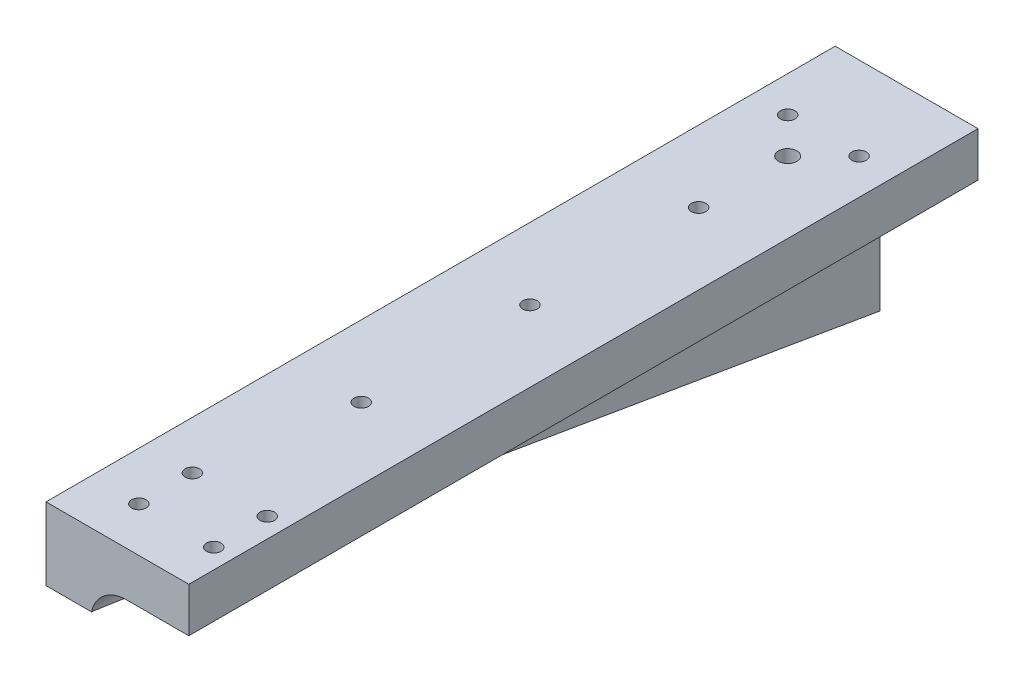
ISO-10303-21;
HEADER;
FILE_DESCRIPTION(('STEP AP214'),'2;1');
FILE_NAME('part.step','',(''),(''),'','','');
FILE_SCHEMA(('AUTOMOTIVE_DESIGN { 1 0 10303 214 1 1 1 1 }'));
ENDSEC;
DATA;
#1=APPLICATION_CONTEXT('core data for automotive mechanical design processes');
#2=APPLICATION_PROTOCOL_DEFINITION('international standard','automotive_design',2000,#1);
#3=PRODUCT_CONTEXT('',#1,'mechanical');
#4=PRODUCT('Part','Part','',(#3));
#5=PRODUCT_RELATED_PRODUCT_CATEGORY('part','',(#4));
#6=PRODUCT_DEFINITION_FORMATION('','',#4);
#7=PRODUCT_DEFINITION_CONTEXT('part definition',#1,'design');
#8=PRODUCT_DEFINITION('design','',#6,#7);
#9=PRODUCT_DEFINITION_SHAPE('','',#8);
#10=(LENGTH_UNIT() NAMED_UNIT(*) SI_UNIT(.MILLI.,.METRE.));
#11=(NAMED_UNIT(*) PLANE_ANGLE_UNIT() SI_UNIT($,.RADIAN.));
#12=(NAMED_UNIT(*) SI_UNIT($,.STERADIAN.) SOLID_ANGLE_UNIT());
#13=UNCERTAINTY_MEASURE_WITH_UNIT(LENGTH_MEASURE(1.E-05),#10,'distance_accuracy_value','');
#14=(GEOMETRIC_REPRESENTATION_CONTEXT(3) GLOBAL_UNCERTAINTY_ASSIGNED_CONTEXT((#13)) GLOBAL_UNIT_ASSIGNED_CONTEXT((#10,
#11,#12)) REPRESENTATION_CONTEXT('',''));
#15=CARTESIAN_POINT('',(0.,0.,0.));
#16=DIRECTION('',(0.,0.,1.));
#17=DIRECTION('',(1.,0.,0.));
#18=AXIS2_PLACEMENT_3D('',#15,#16,#17);
#19=CARTESIAN_POINT('',(-4.7625,-3.9751,0.));
#20=DIRECTION('',(-1.,0.,0.));
#21=DIRECTION('',(0.,0.,1.));
#22=AXIS2_PLACEMENT_3D('',#19,#20,#21);
#23=PLANE('',#22);
#24=DIRECTION('',(0.,0.,-1.));
#25=VECTOR('',#24,1.);
#26=CARTESIAN_POINT('',(-4.7625,-10.3251,169.545));
#27=LINE('',#26,#25);
#28=CARTESIAN_POINT('',(-4.7625,-10.3251,124.04179539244));
#29=VERTEX_POINT('',#28);
#30=CARTESIAN_POINT('',(-4.7625,-10.3251,131.32320460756));
#31=VERTEX_POINT('',#30);
#32=EDGE_CURVE('E183',#29,#31,#27,.F.);
#33=ORIENTED_EDGE('',*,*,#32,.T.);
#34=DIRECTION('',(0.,1.,0.));
#35=VECTOR('',#34,1.);
#36=CARTESIAN_POINT('',(-4.7625,3.9624,131.32320460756));
#37=LINE('',#36,#35);
#38=CARTESIAN_POINT('',(-4.7625,-10.4885520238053,131.32320460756));
#39=VERTEX_POINT('',#38);
#40=EDGE_CURVE('E310',#31,#39,#37,.F.);
#41=ORIENTED_EDGE('',*,*,#40,.T.);
#42=DIRECTION('',(0.,0.167990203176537,0.985788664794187));
#43=VECTOR('',#42,1.);
#44=CARTESIAN_POINT('',(-4.7625,-32.8676,0.));
#45=LINE('',#44,#43);
#46=CARTESIAN_POINT('',(-4.7625,-11.7293914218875,124.04179539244));
#47=VERTEX_POINT('',#46);
#48=EDGE_CURVE('E201',#47,#39,#45,.T.);
#49=ORIENTED_EDGE('',*,*,#48,.F.);
#50=DIRECTION('',(0.,1.,0.));
#51=VECTOR('',#50,1.);
#52=CARTESIAN_POINT('',(-4.7625,3.9624,124.04179539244));
#53=LINE('',#52,#51);
#54=EDGE_CURVE('E311',#47,#29,#53,.T.);
#55=ORIENTED_EDGE('',*,*,#54,.T.);
#56=EDGE_LOOP('',(#33,#41,#49,#55));
#57=FACE_BOUND('',#56,.T.);
#58=ADVANCED_FACE('F46',(#57),#23,.F.);
#59=CARTESIAN_POINT('',(-12.7,3.9624,169.545));
#60=DIRECTION('',(1.,0.,0.));
#61=DIRECTION('',(0.,1.,0.));
#62=AXIS2_PLACEMENT_3D('',#59,#60,#61);
#63=PLANE('',#62);
#64=CARTESIAN_POINT('',(-12.7,-16.4338,6.54558));
#65=DIRECTION('',(-1.,0.,0.));
#66=DIRECTION('',(0.,0.,1.));
#67=AXIS2_PLACEMENT_3D('',#64,#65,#66);
#68=CIRCLE('',#67,1.19062499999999);
#69=CARTESIAN_POINT('',(-12.7,-16.4338,7.73620499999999));
#70=VERTEX_POINT('',#69);
#71=EDGE_CURVE('E407',#70,#70,#68,.T.);
#72=ORIENTED_EDGE('',*,*,#71,.F.);
#73=EDGE_LOOP('',(#72));
#74=FACE_BOUND('',#73,.T.);
#75=CARTESIAN_POINT('',(-12.7,-4.4958,6.54558));
#76=DIRECTION('',(-1.,0.,0.));
#77=DIRECTION('',(0.,0.,1.));
#78=AXIS2_PLACEMENT_3D('',#75,#76,#77);
#79=CIRCLE('',#78,1.28904999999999);
#80=CARTESIAN_POINT('',(-12.7,-4.4958,7.83462999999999));
#81=VERTEX_POINT('',#80);
#82=EDGE_CURVE('E331',#81,#81,#79,.T.);
#83=ORIENTED_EDGE('',*,*,#82,.F.);
#84=EDGE_LOOP('',(#83));
#85=FACE_BOUND('',#84,.T.);
#86=DIRECTION('',(0.,0.167990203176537,0.985788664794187));
#87=VECTOR('',#86,1.);
#88=CARTESIAN_POINT('',(-12.7,-32.8676,0.));
#89=LINE('',#88,#87);
#90=CARTESIAN_POINT('',(-12.7,-32.8676,0.));
#91=VERTEX_POINT('',#90);
#92=CARTESIAN_POINT('',(-12.7,-8.94473951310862,140.3825));
#93=VERTEX_POINT('',#92);
#94=EDGE_CURVE('E202',#91,#93,#89,.T.);
#95=ORIENTED_EDGE('',*,*,#94,.T.);
#96=DIRECTION('',(0.,1.,0.));
#97=VECTOR('',#96,1.);
#98=CARTESIAN_POINT('',(-12.7,-32.8686,140.3825));
#99=LINE('',#98,#97);
#100=CARTESIAN_POINT('',(-12.7,3.9624,140.3825));
#101=VERTEX_POINT('',#100);
#102=EDGE_CURVE('E172',#93,#101,#99,.T.);
#103=ORIENTED_EDGE('',*,*,#102,.T.);
#104=DIRECTION('',(0.,0.,-1.));
#105=VECTOR('',#104,1.);
#106=CARTESIAN_POINT('',(-12.7,3.9624,169.545));
#107=LINE('',#106,#105);
#108=CARTESIAN_POINT('',(-12.7,3.9624,0.));
#109=VERTEX_POINT('',#108);
#110=EDGE_CURVE('E372',#101,#109,#107,.T.);
#111=ORIENTED_EDGE('',*,*,#110,.T.);
#112=DIRECTION('',(0.,-1.,0.));
#113=VECTOR('',#112,1.);
#114=CARTESIAN_POINT('',(-12.7,3.9624,0.));
#115=LINE('',#114,#113);
#116=EDGE_CURVE('E362',#109,#91,#115,.T.);
#117=ORIENTED_EDGE('',*,*,#116,.T.);
#118=EDGE_LOOP('',(#95,#103,#111,#117));
#119=FACE_BOUND('',#118,.T.);
#120=ADVANCED_FACE('F48',(#74,#85,#119),#63,.F.);
#121=CARTESIAN_POINT('',(-12.7,-3.9751,169.545));
#122=DIRECTION('',(0.,1.,0.));
#123=DIRECTION('',(0.,0.,1.));
#124=AXIS2_PLACEMENT_3D('',#121,#122,#123);
#125=PLANE('',#124);
#126=CARTESIAN_POINT('',(6.35,-3.9751,14.8082));
#127=DIRECTION('',(0.,1.,0.));
#128=DIRECTION('',(0.,0.,1.));
#129=AXIS2_PLACEMENT_3D('',#126,#127,#128);
#130=CIRCLE('',#129,1.28904999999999);
#131=CARTESIAN_POINT('',(6.35,-3.9751,16.09725));
#132=VERTEX_POINT('',#131);
#133=EDGE_CURVE('E427',#132,#132,#130,.T.);
#134=ORIENTED_EDGE('',*,*,#133,.T.);
#135=EDGE_LOOP('',(#134));
#136=FACE_BOUND('',#135,.T.);
#137=CARTESIAN_POINT('',(9.2075,-3.9751,132.445));
#138=DIRECTION('',(0.,1.,0.));
#139=DIRECTION('',(0.,0.,1.));
#140=AXIS2_PLACEMENT_3D('',#137,#138,#139);
#141=CIRCLE('',#140,1.28904999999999);
#142=CARTESIAN_POINT('',(9.2075,-3.9751,133.73405));
#143=VERTEX_POINT('',#142);
#144=EDGE_CURVE('E460',#143,#143,#141,.T.);
#145=ORIENTED_EDGE('',*,*,#144,.T.);
#146=EDGE_LOOP('',(#145));
#147=FACE_BOUND('',#146,.T.);
#148=CARTESIAN_POINT('',(9.2075,-3.9751,122.92));
#149=DIRECTION('',(0.,1.,0.));
#150=DIRECTION('',(0.,0.,1.));
#151=AXIS2_PLACEMENT_3D('',#148,#149,#150);
#152=CIRCLE('',#151,1.28904999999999);
#153=CARTESIAN_POINT('',(9.2075,-3.9751,124.20905));
#154=VERTEX_POINT('',#153);
#155=EDGE_CURVE('E325',#154,#154,#152,.T.);
#156=ORIENTED_EDGE('',*,*,#155,.T.);
#157=EDGE_LOOP('',(#156));
#158=FACE_BOUND('',#157,.T.);
#159=DIRECTION('',(0.,0.,-1.));
#160=VECTOR('',#159,1.);
#161=CARTESIAN_POINT('',(12.7,-3.9751,169.545));
#162=LINE('',#161,#160);
#163=CARTESIAN_POINT('',(12.7,-3.9751,140.3825));
#164=VERTEX_POINT('',#163);
#165=CARTESIAN_POINT('',(12.7,-3.9751,0.));
#166=VERTEX_POINT('',#165);
#167=EDGE_CURVE('E177',#164,#166,#162,.T.);
#168=ORIENTED_EDGE('',*,*,#167,.F.);
#169=DIRECTION('',(1.,0.,0.));
#170=VECTOR('',#169,1.);
#171=CARTESIAN_POINT('',(12.7,-3.9751,140.3825));
#172=LINE('',#171,#170);
#173=CARTESIAN_POINT('',(1.5875,-3.9751,140.3825));
#174=VERTEX_POINT('',#173);
#175=EDGE_CURVE('E166',#174,#164,#172,.T.);
#176=ORIENTED_EDGE('',*,*,#175,.F.);
#177=DIRECTION('',(0.,0.,-1.));
#178=VECTOR('',#177,1.);
#179=CARTESIAN_POINT('',(1.5875,-3.9751,0.));
#180=LINE('',#179,#178);
#181=CARTESIAN_POINT('',(1.5875,-3.9751,21.5364916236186));
#182=VERTEX_POINT('',#181);
#183=EDGE_CURVE('E81',#174,#182,#180,.T.);
#184=ORIENTED_EDGE('',*,*,#183,.T.);
#185=CARTESIAN_POINT('',(0.,-3.9751,21.1582));
#186=DIRECTION('',(0.,1.,0.));
#187=DIRECTION('',(0.,0.,1.));
#188=AXIS2_PLACEMENT_3D('',#185,#186,#187);
#189=CIRCLE('',#188,1.63194999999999);
#190=CARTESIAN_POINT('',(1.5875,-3.9751,20.7799083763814));
#191=VERTEX_POINT('',#190);
#192=EDGE_CURVE('E404',#182,#191,#189,.T.);
#193=ORIENTED_EDGE('',*,*,#192,.T.);
#194=CARTESIAN_POINT('',(1.5875,-3.9751,0.));
#195=VERTEX_POINT('',#194);
#196=EDGE_CURVE('E184',#191,#195,#180,.T.);
#197=ORIENTED_EDGE('',*,*,#196,.T.);
#198=DIRECTION('',(1.,0.,0.));
#199=VECTOR('',#198,1.);
#200=CARTESIAN_POINT('',(-12.7,-3.9751,0.));
#201=LINE('',#200,#199);
#202=EDGE_CURVE('E195',#195,#166,#201,.T.);
#203=ORIENTED_EDGE('',*,*,#202,.T.);
#204=EDGE_LOOP('',(#168,#176,#184,#193,#197,#203));
#205=FACE_BOUND('',#204,.T.);
#206=ADVANCED_FACE('F175',(#136,#147,#158,#205),#125,.F.);
#207=CARTESIAN_POINT('',(12.7,3.9624,169.545));
#208=DIRECTION('',(-1.,0.,0.));
#209=DIRECTION('',(0.,0.,1.));
#210=AXIS2_PLACEMENT_3D('',#207,#208,#209);
#211=PLANE('',#210);
#212=DIRECTION('',(0.,0.,-1.));
#213=VECTOR('',#212,1.);
#214=CARTESIAN_POINT('',(12.7,3.9624,169.545));
#215=LINE('',#214,#213);
#216=CARTESIAN_POINT('',(12.7,3.9624,140.3825));
#217=VERTEX_POINT('',#216);
#218=CARTESIAN_POINT('',(12.7,3.9624,0.));
#219=VERTEX_POINT('',#218);
#220=EDGE_CURVE('E374',#217,#219,#215,.T.);
#221=ORIENTED_EDGE('',*,*,#220,.F.);
#222=DIRECTION('',(0.,1.,0.));
#223=VECTOR('',#222,1.);
#224=CARTESIAN_POINT('',(12.7,-32.8686,140.3825));
#225=LINE('',#224,#223);
#226=EDGE_CURVE('E384',#164,#217,#225,.T.);
#227=ORIENTED_EDGE('',*,*,#226,.F.);
#228=ORIENTED_EDGE('',*,*,#167,.T.);
#229=DIRECTION('',(0.,1.,0.));
#230=VECTOR('',#229,1.);
#231=CARTESIAN_POINT('',(12.7,3.9624,0.));
#232=LINE('',#231,#230);
#233=EDGE_CURVE('E366',#166,#219,#232,.T.);
#234=ORIENTED_EDGE('',*,*,#233,.T.);
#235=EDGE_LOOP('',(#221,#227,#228,#234));
#236=FACE_BOUND('',#235,.T.);
#237=ADVANCED_FACE('F381',(#236),#211,.F.);
#238=CARTESIAN_POINT('',(-12.7,3.9624,169.545));
#239=DIRECTION('',(0.,-1.,0.));
#240=DIRECTION('',(0.,0.,-1.));
#241=AXIS2_PLACEMENT_3D('',#238,#239,#240);
#242=PLANE('',#241);
#243=CARTESIAN_POINT('',(0.,3.9624,21.1582));
#244=DIRECTION('',(0.,1.,0.));
#245=DIRECTION('',(0.,0.,1.));
#246=AXIS2_PLACEMENT_3D('',#243,#244,#245);
#247=CIRCLE('',#246,1.63194999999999);
#248=CARTESIAN_POINT('',(0.,3.9624,22.79015));
#249=VERTEX_POINT('',#248);
#250=EDGE_CURVE('E178',#249,#249,#247,.T.);
#251=ORIENTED_EDGE('',*,*,#250,.F.);
#252=EDGE_LOOP('',(#251));
#253=FACE_BOUND('',#252,.T.);
#254=CARTESIAN_POINT('',(-6.35,3.9624,14.8082));
#255=DIRECTION('',(0.,1.,0.));
#256=DIRECTION('',(0.,0.,1.));
#257=AXIS2_PLACEMENT_3D('',#254,#255,#256);
#258=CIRCLE('',#257,1.28904999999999);
#259=CARTESIAN_POINT('',(-6.35,3.9624,16.09725));
#260=VERTEX_POINT('',#259);
#261=EDGE_CURVE('E419',#260,#260,#258,.T.);
#262=ORIENTED_EDGE('',*,*,#261,.F.);
#263=EDGE_LOOP('',(#262));
#264=FACE_BOUND('',#263,.T.);
#265=CARTESIAN_POINT('',(6.35,3.9624,14.8082));
#266=DIRECTION('',(0.,1.,0.));
#267=DIRECTION('',(0.,0.,1.));
#268=AXIS2_PLACEMENT_3D('',#265,#266,#267);
#269=CIRCLE('',#268,1.28904999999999);
#270=CARTESIAN_POINT('',(6.35,3.9624,16.09725));
#271=VERTEX_POINT('',#270);
#272=EDGE_CURVE('E423',#271,#271,#269,.T.);
#273=ORIENTED_EDGE('',*,*,#272,.F.);
#274=EDGE_LOOP('',(#273));
#275=FACE_BOUND('',#274,.T.);
#276=CARTESIAN_POINT('',(0.,3.9624,36.997248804));
#277=DIRECTION('',(0.,1.,0.));
#278=DIRECTION('',(0.,0.,1.));
#279=AXIS2_PLACEMENT_3D('',#276,#277,#278);
#280=CIRCLE('',#279,1.28904999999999);
#281=CARTESIAN_POINT('',(0.,3.9624,38.286298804));
#282=VERTEX_POINT('',#281);
#283=EDGE_CURVE('E444',#282,#282,#280,.T.);
#284=ORIENTED_EDGE('',*,*,#283,.F.);
#285=EDGE_LOOP('',(#284));
#286=FACE_BOUND('',#285,.T.);
#287=CARTESIAN_POINT('',(0.,3.9624,66.997248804));
#288=DIRECTION('',(0.,1.,0.));
#289=DIRECTION('',(0.,0.,1.));
#290=AXIS2_PLACEMENT_3D('',#287,#288,#289);
#291=CIRCLE('',#290,1.28904999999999);
#292=CARTESIAN_POINT('',(0.,3.9624,68.286298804));
#293=VERTEX_POINT('',#292);
#294=EDGE_CURVE('E449',#293,#293,#291,.T.);
#295=ORIENTED_EDGE('',*,*,#294,.F.);
#296=EDGE_LOOP('',(#295));
#297=FACE_BOUND('',#296,.T.);
#298=CARTESIAN_POINT('',(0.,3.9624,96.997248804));
#299=DIRECTION('',(0.,1.,0.));
#300=DIRECTION('',(0.,0.,1.));
#301=AXIS2_PLACEMENT_3D('',#298,#299,#300);
#302=CIRCLE('',#301,1.28904999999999);
#303=CARTESIAN_POINT('',(0.,3.9624,98.286298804));
#304=VERTEX_POINT('',#303);
#305=EDGE_CURVE('E454',#304,#304,#302,.T.);
#306=ORIENTED_EDGE('',*,*,#305,.F.);
#307=EDGE_LOOP('',(#306));
#308=FACE_BOUND('',#307,.T.);
#309=CARTESIAN_POINT('',(9.2075,3.9624,132.445));
#310=DIRECTION('',(0.,1.,0.));
#311=DIRECTION('',(0.,0.,1.));
#312=AXIS2_PLACEMENT_3D('',#309,#310,#311);
#313=CIRCLE('',#312,1.28904999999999);
#314=CARTESIAN_POINT('',(9.2075,3.9624,133.73405));
#315=VERTEX_POINT('',#314);
#316=EDGE_CURVE('E457',#315,#315,#313,.T.);
#317=ORIENTED_EDGE('',*,*,#316,.F.);
#318=EDGE_LOOP('',(#317));
#319=FACE_BOUND('',#318,.T.);
#320=CARTESIAN_POINT('',(-4.1275,3.9624,132.445));
#321=DIRECTION('',(0.,1.,0.));
#322=DIRECTION('',(0.,0.,1.));
#323=AXIS2_PLACEMENT_3D('',#320,#321,#322);
#324=CIRCLE('',#323,1.28904999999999);
#325=CARTESIAN_POINT('',(-4.1275,3.9624,133.73405));
#326=VERTEX_POINT('',#325);
#327=EDGE_CURVE('E463',#326,#326,#324,.T.);
#328=ORIENTED_EDGE('',*,*,#327,.F.);
#329=EDGE_LOOP('',(#328));
#330=FACE_BOUND('',#329,.T.);
#331=CARTESIAN_POINT('',(-4.1275,3.9624,122.92));
#332=DIRECTION('',(0.,1.,0.));
#333=DIRECTION('',(0.,0.,1.));
#334=AXIS2_PLACEMENT_3D('',#331,#332,#333);
#335=CIRCLE('',#334,1.28904999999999);
#336=CARTESIAN_POINT('',(-4.1275,3.9624,124.20905));
#337=VERTEX_POINT('',#336);
#338=EDGE_CURVE('E318',#337,#337,#335,.T.);
#339=ORIENTED_EDGE('',*,*,#338,.F.);
#340=EDGE_LOOP('',(#339));
#341=FACE_BOUND('',#340,.T.);
#342=CARTESIAN_POINT('',(9.2075,3.9624,122.92));
#343=DIRECTION('',(0.,1.,0.));
#344=DIRECTION('',(0.,0.,1.));
#345=AXIS2_PLACEMENT_3D('',#342,#343,#344);
#346=CIRCLE('',#345,1.28904999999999);
#347=CARTESIAN_POINT('',(9.2075,3.9624,124.20905));
#348=VERTEX_POINT('',#347);
#349=EDGE_CURVE('E316',#348,#348,#346,.T.);
#350=ORIENTED_EDGE('',*,*,#349,.F.);
#351=EDGE_LOOP('',(#350));
#352=FACE_BOUND('',#351,.T.);
#353=ORIENTED_EDGE('',*,*,#110,.F.);
#354=DIRECTION('',(-1.,0.,0.));
#355=VECTOR('',#354,1.);
#356=CARTESIAN_POINT('',(12.7,3.9624,140.3825));
#357=LINE('',#356,#355);
#358=EDGE_CURVE('E389',#217,#101,#357,.T.);
#359=ORIENTED_EDGE('',*,*,#358,.F.);
#360=ORIENTED_EDGE('',*,*,#220,.T.);
#361=DIRECTION('',(-1.,0.,0.));
#362=VECTOR('',#361,1.);
#363=CARTESIAN_POINT('',(-12.7,3.9624,0.));
#364=LINE('',#363,#362);
#365=EDGE_CURVE('E369',#219,#109,#364,.T.);
#366=ORIENTED_EDGE('',*,*,#365,.T.);
#367=EDGE_LOOP('',(#353,#359,#360,#366));
#368=FACE_BOUND('',#367,.T.);
#369=ADVANCED_FACE('F388',(#253,#264,#275,#286,#297,#308,#319,#330,#341,#352,#368),#242,.F.);
#370=CARTESIAN_POINT('',(-12.7,-3.9751,0.));
#371=DIRECTION('',(0.,0.,1.));
#372=DIRECTION('',(1.,0.,0.));
#373=AXIS2_PLACEMENT_3D('',#370,#371,#372);
#374=PLANE('',#373);
#375=CARTESIAN_POINT('',(-8.7376,-12.6238,0.));
#376=DIRECTION('',(0.,0.,-1.));
#377=DIRECTION('',(-1.,0.,0.));
#378=AXIS2_PLACEMENT_3D('',#375,#376,#377);
#379=CIRCLE('',#378,2.39395);
#380=CARTESIAN_POINT('',(-11.13155,-12.6238,0.));
#381=VERTEX_POINT('',#380);
#382=EDGE_CURVE('E435',#381,#381,#379,.T.);
#383=ORIENTED_EDGE('',*,*,#382,.F.);
#384=EDGE_LOOP('',(#383));
#385=FACE_BOUND('',#384,.T.);
#386=CARTESIAN_POINT('',(0.,0.,0.));
#387=DIRECTION('',(0.,0.,-1.));
#388=DIRECTION('',(-1.,0.,0.));
#389=AXIS2_PLACEMENT_3D('',#386,#387,#388);
#390=CIRCLE('',#389,2.39395);
#391=CARTESIAN_POINT('',(-2.39395,0.,0.));
#392=VERTEX_POINT('',#391);
#393=EDGE_CURVE('E441',#392,#392,#390,.T.);
#394=ORIENTED_EDGE('',*,*,#393,.F.);
#395=EDGE_LOOP('',(#394));
#396=FACE_BOUND('',#395,.T.);
#397=CARTESIAN_POINT('',(-8.7376,0.,0.));
#398=DIRECTION('',(0.,0.,-1.));
#399=DIRECTION('',(-1.,0.,0.));
#400=AXIS2_PLACEMENT_3D('',#397,#398,#399);
#401=CIRCLE('',#400,1.7272);
#402=CARTESIAN_POINT('',(-10.4648,0.,0.));
#403=VERTEX_POINT('',#402);
#404=EDGE_CURVE('E339',#403,#403,#401,.T.);
#405=ORIENTED_EDGE('',*,*,#404,.F.);
#406=EDGE_LOOP('',(#405));
#407=FACE_BOUND('',#406,.T.);
#408=CARTESIAN_POINT('',(-8.7376,-25.2476,0.));
#409=DIRECTION('',(0.,0.,-1.));
#410=DIRECTION('',(-1.,0.,0.));
#411=AXIS2_PLACEMENT_3D('',#408,#409,#410);
#412=CIRCLE('',#411,1.7272);
#413=CARTESIAN_POINT('',(-10.4648,-25.2476,0.));
#414=VERTEX_POINT('',#413);
#415=EDGE_CURVE('E346',#414,#414,#412,.T.);
#416=ORIENTED_EDGE('',*,*,#415,.F.);
#417=EDGE_LOOP('',(#416));
#418=FACE_BOUND('',#417,.T.);
#419=CARTESIAN_POINT('',(8.7376,0.,0.));
#420=DIRECTION('',(0.,0.,-1.));
#421=DIRECTION('',(-1.,0.,0.));
#422=AXIS2_PLACEMENT_3D('',#419,#420,#421);
#423=CIRCLE('',#422,1.7272);
#424=CARTESIAN_POINT('',(7.0104,0.,0.));
#425=VERTEX_POINT('',#424);
#426=EDGE_CURVE('E354',#425,#425,#423,.T.);
#427=ORIENTED_EDGE('',*,*,#426,.F.);
#428=EDGE_LOOP('',(#427));
#429=FACE_BOUND('',#428,.T.);
#430=ORIENTED_EDGE('',*,*,#116,.F.);
#431=ORIENTED_EDGE('',*,*,#365,.F.);
#432=ORIENTED_EDGE('',*,*,#233,.F.);
#433=ORIENTED_EDGE('',*,*,#202,.F.);
#434=CARTESIAN_POINT('',(1.5875,-10.3251,0.));
#435=DIRECTION('',(0.,0.,1.));
#436=DIRECTION('',(1.,0.,0.));
#437=AXIS2_PLACEMENT_3D('',#434,#435,#436);
#438=CIRCLE('',#437,6.35);
#439=CARTESIAN_POINT('',(-4.7625,-10.3251,0.));
#440=VERTEX_POINT('',#439);
#441=EDGE_CURVE('E294',#195,#440,#438,.T.);
#442=ORIENTED_EDGE('',*,*,#441,.T.);
#443=DIRECTION('',(0.,-1.,0.));
#444=VECTOR('',#443,1.);
#445=CARTESIAN_POINT('',(-4.7625,-3.9751,0.));
#446=LINE('',#445,#444);
#447=CARTESIAN_POINT('',(-4.7625,-32.8676,0.));
#448=VERTEX_POINT('',#447);
#449=EDGE_CURVE('E198',#440,#448,#446,.T.);
#450=ORIENTED_EDGE('',*,*,#449,.T.);
#451=DIRECTION('',(-1.,0.,0.));
#452=VECTOR('',#451,1.);
#453=CARTESIAN_POINT('',(-4.7625,-32.8676,0.));
#454=LINE('',#453,#452);
#455=EDGE_CURVE('E211',#448,#91,#454,.T.);
#456=ORIENTED_EDGE('',*,*,#455,.T.);
#457=EDGE_LOOP('',(#430,#431,#432,#433,#442,#450,#456));
#458=FACE_BOUND('',#457,.T.);
#459=ADVANCED_FACE('F386',(#385,#396,#407,#418,#429,#458),#374,.F.);
#460=CARTESIAN_POINT('',(-4.7625,-32.8676,0.));
#461=DIRECTION('',(0.,-0.985788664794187,0.167990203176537));
#462=DIRECTION('',(0.,-0.167990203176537,-0.985788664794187));
#463=AXIS2_PLACEMENT_3D('',#460,#461,#462);
#464=PLANE('',#463);
#465=DIRECTION('',(-1.,0.,0.));
#466=VECTOR('',#465,1.);
#467=CARTESIAN_POINT('',(12.7,-8.94473951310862,140.3825));
#468=LINE('',#467,#466);
#469=CARTESIAN_POINT('',(-4.61065334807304,-8.94473951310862,140.3825));
#470=VERTEX_POINT('',#469);
#471=EDGE_CURVE('E70',#470,#93,#468,.T.);
#472=ORIENTED_EDGE('',*,*,#471,.T.);
#473=ORIENTED_EDGE('',*,*,#94,.F.);
#474=ORIENTED_EDGE('',*,*,#455,.F.);
#475=CARTESIAN_POINT('',(-4.7625,-12.1117261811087,121.79820460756));
#476=VERTEX_POINT('',#475);
#477=EDGE_CURVE('E208',#448,#476,#45,.T.);
#478=ORIENTED_EDGE('',*,*,#477,.T.);
#479=CARTESIAN_POINT('',(-4.1275,-11.9205588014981,122.92));
#480=DIRECTION('',(0.,-0.985788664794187,0.167990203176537));
#481=DIRECTION('',(0.,0.167990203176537,0.985788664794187));
#482=AXIS2_PLACEMENT_3D('',#479,#480,#481);
#483=ELLIPSE('',#482,1.30763321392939,1.28904999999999);
#484=EDGE_CURVE('E313',#47,#476,#483,.T.);
#485=ORIENTED_EDGE('',*,*,#484,.F.);
#486=ORIENTED_EDGE('',*,*,#48,.T.);
#487=CARTESIAN_POINT('',(-4.1275,-10.2973846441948,132.445));
#488=DIRECTION('',(0.,-0.985788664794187,0.167990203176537));
#489=DIRECTION('',(0.,0.167990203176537,0.985788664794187));
#490=AXIS2_PLACEMENT_3D('',#487,#488,#489);
#491=ELLIPSE('',#490,1.30763321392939,1.28904999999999);
#492=CARTESIAN_POINT('',(-4.75871390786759,-10.1058534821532,133.568930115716));
#493=VERTEX_POINT('',#492);
#494=EDGE_CURVE('E305',#493,#39,#491,.T.);
#495=ORIENTED_EDGE('',*,*,#494,.F.);
#496=CARTESIAN_POINT('',(1.5875,-10.3251,132.282362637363));
#497=DIRECTION('',(0.,-0.985788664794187,0.167990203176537));
#498=DIRECTION('',(0.,0.167990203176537,0.985788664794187));
#499=AXIS2_PLACEMENT_3D('',#496,#497,#498);
#500=ELLIPSE('',#499,37.7998233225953,6.35);
#501=EDGE_CURVE('E271',#493,#470,#500,.F.);
#502=ORIENTED_EDGE('',*,*,#501,.T.);
#503=EDGE_LOOP('',(#472,#473,#474,#478,#485,#486,#495,#502));
#504=FACE_BOUND('',#503,.T.);
#505=ADVANCED_FACE('F302',(#504),#464,.T.);
#506=CARTESIAN_POINT('',(-4.7625,-10.3251,121.79820460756));
#507=VERTEX_POINT('',#506);
#508=EDGE_CURVE('E190',#440,#507,#27,.F.);
#509=ORIENTED_EDGE('',*,*,#508,.T.);
#510=DIRECTION('',(0.,1.,0.));
#511=VECTOR('',#510,1.);
#512=CARTESIAN_POINT('',(-4.7625,3.9624,121.79820460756));
#513=LINE('',#512,#511);
#514=EDGE_CURVE('E292',#507,#476,#513,.F.);
#515=ORIENTED_EDGE('',*,*,#514,.T.);
#516=ORIENTED_EDGE('',*,*,#477,.F.);
#517=ORIENTED_EDGE('',*,*,#449,.F.);
#518=EDGE_LOOP('',(#509,#515,#516,#517));
#519=FACE_BOUND('',#518,.T.);
#520=ADVANCED_FACE('F290',(#519),#23,.F.);
#521=CARTESIAN_POINT('',(1.5875,-10.3251,169.545));
#522=DIRECTION('',(0.,0.,1.));
#523=DIRECTION('',(1.,0.,0.));
#524=AXIS2_PLACEMENT_3D('',#521,#522,#523);
#525=CYLINDRICAL_SURFACE('',#524,6.35);
#526=CARTESIAN_POINT('',(0.,-4.17673893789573,38.286298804));
#527=CARTESIAN_POINT('',(0.0709354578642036,-4.15842422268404,38.286297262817));
#528=CARTESIAN_POINT('',(0.142209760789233,-4.14134203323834,38.2804286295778));
#529=CARTESIAN_POINT('',(0.283424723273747,-4.11002780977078,38.2567909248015));
#530=CARTESIAN_POINT('',(0.353365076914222,-4.09579642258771,38.2390191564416));
#531=CARTESIAN_POINT('',(0.489849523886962,-4.07030261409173,38.1917848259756));
#532=CARTESIAN_POINT('',(0.55638994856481,-4.05904334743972,38.1623099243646));
#533=CARTESIAN_POINT('',(0.683872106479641,-4.03939227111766,38.0923535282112));
#534=CARTESIAN_POINT('',(0.74481427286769,-4.03100023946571,38.0518728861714));
#535=CARTESIAN_POINT('',(0.858065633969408,-4.01688095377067,37.9618764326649));
#536=CARTESIAN_POINT('',(0.910516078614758,-4.01110638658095,37.9125456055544));
#537=CARTESIAN_POINT('',(1.00655461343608,-4.0015458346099,37.8057384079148));
#538=CARTESIAN_POINT('',(1.05014275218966,-3.99775983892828,37.748262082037));
#539=CARTESIAN_POINT('',(1.12708882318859,-3.9916953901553,37.6269101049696));
#540=CARTESIAN_POINT('',(1.16046568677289,-3.98941413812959,37.5630465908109));
#541=CARTESIAN_POINT('',(1.21613627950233,-3.98590674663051,37.4306320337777));
#542=CARTESIAN_POINT('',(1.2384297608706,-3.98468063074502,37.3620808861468));
#543=CARTESIAN_POINT('',(1.27138697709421,-3.98295136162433,37.2218399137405));
#544=CARTESIAN_POINT('',(1.28198769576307,-3.98245212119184,37.1501352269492));
#545=CARTESIAN_POINT('',(1.2910427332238,-3.98202233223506,37.0059607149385));
#546=CARTESIAN_POINT('',(1.28949683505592,-3.98209179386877,36.9334908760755));
#547=CARTESIAN_POINT('',(1.27428516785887,-3.98282490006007,36.7896739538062));
#548=CARTESIAN_POINT('',(1.26059251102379,-3.98348986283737,36.7183297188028));
#549=CARTESIAN_POINT('',(1.2214423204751,-3.98562976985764,36.5789572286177));
#550=CARTESIAN_POINT('',(1.19598472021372,-3.98710471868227,36.510928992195));
#551=CARTESIAN_POINT('',(1.13406501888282,-3.99123436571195,36.3801793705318));
#552=CARTESIAN_POINT('',(1.09761114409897,-3.99388818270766,36.3174540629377));
#553=CARTESIAN_POINT('',(1.01476743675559,-4.00084518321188,36.1990529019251));
#554=CARTESIAN_POINT('',(0.968378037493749,-4.00514829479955,36.143376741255));
#555=CARTESIAN_POINT('',(0.867287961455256,-4.01587182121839,36.0408915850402));
#556=CARTESIAN_POINT('',(0.812624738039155,-4.02228284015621,35.9940446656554));
#557=CARTESIAN_POINT('',(0.696517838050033,-4.03764635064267,35.9102165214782));
#558=CARTESIAN_POINT('',(0.635074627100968,-4.04659866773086,35.8732346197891));
#559=CARTESIAN_POINT('',(0.507540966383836,-4.06727756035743,35.8101962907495));
#560=CARTESIAN_POINT('',(0.441468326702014,-4.07899387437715,35.7841004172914));
#561=CARTESIAN_POINT('',(0.306470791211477,-4.10527754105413,35.7431747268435));
#562=CARTESIAN_POINT('',(0.237545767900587,-4.11984502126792,35.7283454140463));
#563=CARTESIAN_POINT('',(0.0978378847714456,-4.15188253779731,35.7099600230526));
#564=CARTESIAN_POINT('',(0.0270425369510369,-4.16939072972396,35.706566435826));
#565=CARTESIAN_POINT('',(-0.11353506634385,-4.20674447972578,35.7112824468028));
#566=CARTESIAN_POINT('',(-0.183317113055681,-4.22659051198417,35.7193943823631));
#567=CARTESIAN_POINT('',(-0.32302568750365,-4.26886868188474,35.7472137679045));
#568=CARTESIAN_POINT('',(-0.39283601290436,-4.29137429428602,35.7673923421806));
#569=CARTESIAN_POINT('',(-0.527830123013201,-4.33736494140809,35.8189994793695));
#570=CARTESIAN_POINT('',(-0.593012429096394,-4.36085028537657,35.8504316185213));
#571=CARTESIAN_POINT('',(-0.720124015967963,-4.40883454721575,35.9254440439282));
#572=CARTESIAN_POINT('',(-0.781763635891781,-4.43333013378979,35.9695187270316));
#573=CARTESIAN_POINT('',(-0.8967210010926,-4.48087025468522,36.0681219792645));
#574=CARTESIAN_POINT('',(-0.950037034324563,-4.50391448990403,36.122652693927));
#575=CARTESIAN_POINT('',(-1.04651998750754,-4.54693216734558,36.2407839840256));
#576=CARTESIAN_POINT('',(-1.08972301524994,-4.56691644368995,36.3043509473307));
#577=CARTESIAN_POINT('',(-1.16451600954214,-4.60228344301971,36.4391446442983));
#578=CARTESIAN_POINT('',(-1.19611446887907,-4.61766952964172,36.5103657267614));
#579=CARTESIAN_POINT('',(-1.2440722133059,-4.64131969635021,36.6521884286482));
#580=CARTESIAN_POINT('',(-1.26147431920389,-4.65006692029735,36.7223556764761));
#581=CARTESIAN_POINT('',(-1.28428647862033,-4.66157515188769,36.8650773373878));
#582=CARTESIAN_POINT('',(-1.28970511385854,-4.66434044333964,36.9376300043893));
#583=CARTESIAN_POINT('',(-1.28833269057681,-4.66364434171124,37.0759266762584));
#584=CARTESIAN_POINT('',(-1.28261174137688,-4.66072866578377,37.1416872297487));
#585=CARTESIAN_POINT('',(-1.26131711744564,-4.64998930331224,37.2711709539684));
#586=CARTESIAN_POINT('',(-1.24574338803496,-4.64216558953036,37.334894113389));
#587=CARTESIAN_POINT('',(-1.20547870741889,-4.62227027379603,37.4584212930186));
#588=CARTESIAN_POINT('',(-1.18081831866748,-4.61021291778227,37.5182376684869));
#589=CARTESIAN_POINT('',(-1.12326012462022,-4.58268812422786,37.6329025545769));
#590=CARTESIAN_POINT('',(-1.0903600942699,-4.56721976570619,37.6877497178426));
#591=CARTESIAN_POINT('',(-1.01427954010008,-4.53242113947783,37.795747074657));
#592=CARTESIAN_POINT('',(-0.970477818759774,-4.51287836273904,37.8483905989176));
#593=CARTESIAN_POINT('',(-0.875530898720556,-4.47201103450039,37.9457879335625));
#594=CARTESIAN_POINT('',(-0.824381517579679,-4.45068547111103,37.990537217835));
#595=CARTESIAN_POINT('',(-0.710921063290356,-4.40531776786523,38.0750672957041));
#596=CARTESIAN_POINT('',(-0.648016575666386,-4.38120584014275,38.1140162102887));
#597=CARTESIAN_POINT('',(-0.516391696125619,-4.33335275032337,38.1806450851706));
#598=CARTESIAN_POINT('',(-0.447673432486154,-4.30961145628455,38.2083291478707));
#599=CARTESIAN_POINT('',(-0.316311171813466,-4.26687687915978,38.2484926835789));
#600=CARTESIAN_POINT('',(-0.254219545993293,-4.24769250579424,38.2625886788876));
#601=CARTESIAN_POINT('',(-0.128177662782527,-4.21091510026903,38.2814916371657));
#602=CARTESIAN_POINT('',(-0.0642277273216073,-4.1933217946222,38.2863001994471));
#603=CARTESIAN_POINT('',(0.,-4.17673893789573,38.286298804));
#604=B_SPLINE_CURVE_WITH_KNOTS('',3,(#526,#527,#528,#529,#530,#531,#532,#533,#534,#535,#536,
#537,#538,#539,#540,#541,#542,#543,#544,#545,#546,#547,#548,#549,#550,#551,#552,#553,#554,#555,
#556,#557,#558,#559,#560,#561,#562,#563,#564,#565,#566,#567,#568,#569,#570,#571,#572,#573,#574,
#575,#576,#577,#578,#579,#580,#581,#582,#583,#584,#585,#586,#587,#588,#589,#590,#591,#592,#593,
#594,#595,#596,#597,#598,#599,#600,#601,#602,#603),.UNSPECIFIED.,.T.,.F.,(4,2,2,2,2,2,2,2,2,2,2,
2,2,2,2,2,2,2,2,2,2,2,2,2,2,2,2,2,2,2,2,2,2,2,2,2,2,2,4),(0.,0.219560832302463,
0.439171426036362,0.65901418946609,0.878839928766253,1.09451596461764,1.31019081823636,
1.52546336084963,1.74074071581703,1.95717268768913,2.17360852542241,2.390524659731,
2.60744202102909,2.8241975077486,3.04094354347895,3.25673625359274,3.47251415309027,
3.68750323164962,3.90250193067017,4.12054296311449,4.33862829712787,4.56584168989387,
4.79312735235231,5.03091957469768,5.26876064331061,5.50573910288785,5.74254378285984,
5.95979657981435,6.17689374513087,6.37415963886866,6.57142662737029,6.76803608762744,
6.96469869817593,7.17746418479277,7.39035126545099,7.62275971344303,7.85508344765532,
8.0539166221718,8.25271555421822),.UNSPECIFIED.);
#605=CARTESIAN_POINT('',(0.,-4.17673893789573,38.286298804));
#606=VERTEX_POINT('',#605);
#607=EDGE_CURVE('E448',#606,#606,#604,.T.);
#608=ORIENTED_EDGE('',*,*,#607,.T.);
#609=EDGE_LOOP('',(#608));
#610=FACE_BOUND('',#609,.T.);
#611=CARTESIAN_POINT('',(0.,-4.17673893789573,68.286298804));
#612=CARTESIAN_POINT('',(0.0709354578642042,-4.15842422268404,68.286297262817));
#613=CARTESIAN_POINT('',(0.142209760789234,-4.14134203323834,68.2804286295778));
#614=CARTESIAN_POINT('',(0.283424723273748,-4.11002780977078,68.2567909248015));
#615=CARTESIAN_POINT('',(0.353365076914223,-4.09579642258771,68.2390191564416));
#616=CARTESIAN_POINT('',(0.489849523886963,-4.07030261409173,68.1917848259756));
#617=CARTESIAN_POINT('',(0.55638994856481,-4.05904334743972,68.1623099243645));
#618=CARTESIAN_POINT('',(0.683872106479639,-4.03939227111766,68.0923535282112));
#619=CARTESIAN_POINT('',(0.744814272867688,-4.03100023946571,68.0518728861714));
#620=CARTESIAN_POINT('',(0.858065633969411,-4.01688095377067,67.9618764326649));
#621=CARTESIAN_POINT('',(0.910516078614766,-4.01110638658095,67.9125456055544));
#622=CARTESIAN_POINT('',(1.00655461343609,-4.0015458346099,67.8057384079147));
#623=CARTESIAN_POINT('',(1.05014275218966,-3.99775983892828,67.748262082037));
#624=CARTESIAN_POINT('',(1.12708882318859,-3.9916953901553,67.6269101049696));
#625=CARTESIAN_POINT('',(1.16046568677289,-3.98941413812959,67.5630465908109));
#626=CARTESIAN_POINT('',(1.21613627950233,-3.98590674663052,67.4306320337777));
#627=CARTESIAN_POINT('',(1.2384297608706,-3.98468063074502,67.3620808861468));
#628=CARTESIAN_POINT('',(1.27138697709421,-3.98295136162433,67.2218399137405));
#629=CARTESIAN_POINT('',(1.28198769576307,-3.98245212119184,67.1501352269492));
#630=CARTESIAN_POINT('',(1.2910427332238,-3.98202233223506,67.0059607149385));
#631=CARTESIAN_POINT('',(1.28949683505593,-3.98209179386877,66.9334908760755));
#632=CARTESIAN_POINT('',(1.27428516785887,-3.98282490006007,66.7896739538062));
#633=CARTESIAN_POINT('',(1.26059251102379,-3.98348986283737,66.7183297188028));
#634=CARTESIAN_POINT('',(1.2214423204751,-3.98562976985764,66.5789572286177));
#635=CARTESIAN_POINT('',(1.19598472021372,-3.98710471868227,66.510928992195));
#636=CARTESIAN_POINT('',(1.13406501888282,-3.99123436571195,66.3801793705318));
#637=CARTESIAN_POINT('',(1.09761114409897,-3.99388818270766,66.3174540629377));
#638=CARTESIAN_POINT('',(1.01476743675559,-4.00084518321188,66.1990529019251));
#639=CARTESIAN_POINT('',(0.968378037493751,-4.00514829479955,66.143376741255));
#640=CARTESIAN_POINT('',(0.867287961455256,-4.01587182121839,66.0408915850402));
#641=CARTESIAN_POINT('',(0.812624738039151,-4.02228284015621,65.9940446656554));
#642=CARTESIAN_POINT('',(0.696517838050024,-4.03764635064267,65.9102165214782));
#643=CARTESIAN_POINT('',(0.635074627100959,-4.04659866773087,65.8732346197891));
#644=CARTESIAN_POINT('',(0.507540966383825,-4.06727756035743,65.8101962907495));
#645=CARTESIAN_POINT('',(0.441468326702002,-4.07899387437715,65.7841004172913));
#646=CARTESIAN_POINT('',(0.306470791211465,-4.10527754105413,65.7431747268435));
#647=CARTESIAN_POINT('',(0.237545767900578,-4.11984502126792,65.7283454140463));
#648=CARTESIAN_POINT('',(0.0978378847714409,-4.15188253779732,65.7099600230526));
#649=CARTESIAN_POINT('',(0.0270425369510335,-4.16939072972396,65.706566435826));
#650=CARTESIAN_POINT('',(-0.113535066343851,-4.20674447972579,65.7112824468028));
#651=CARTESIAN_POINT('',(-0.183317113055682,-4.22659051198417,65.7193943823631));
#652=CARTESIAN_POINT('',(-0.323025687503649,-4.26886868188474,65.7472137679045));
#653=CARTESIAN_POINT('',(-0.392836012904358,-4.29137429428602,65.7673923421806));
#654=CARTESIAN_POINT('',(-0.527830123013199,-4.33736494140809,65.8189994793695));
#655=CARTESIAN_POINT('',(-0.593012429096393,-4.36085028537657,65.8504316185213));
#656=CARTESIAN_POINT('',(-0.720124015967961,-4.40883454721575,65.9254440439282));
#657=CARTESIAN_POINT('',(-0.781763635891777,-4.43333013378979,65.9695187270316));
#658=CARTESIAN_POINT('',(-0.896721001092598,-4.48087025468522,66.0681219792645));
#659=CARTESIAN_POINT('',(-0.950037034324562,-4.50391448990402,66.122652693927));
#660=CARTESIAN_POINT('',(-1.04651998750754,-4.54693216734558,66.2407839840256));
#661=CARTESIAN_POINT('',(-1.08972301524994,-4.56691644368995,66.3043509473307));
#662=CARTESIAN_POINT('',(-1.16451600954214,-4.60228344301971,66.4391446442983));
#663=CARTESIAN_POINT('',(-1.19611446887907,-4.61766952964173,66.5103657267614));
#664=CARTESIAN_POINT('',(-1.24407221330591,-4.64131969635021,66.6521884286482));
#665=CARTESIAN_POINT('',(-1.26147431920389,-4.65006692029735,66.7223556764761));
#666=CARTESIAN_POINT('',(-1.28428647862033,-4.66157515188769,66.8650773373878));
#667=CARTESIAN_POINT('',(-1.28970511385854,-4.66434044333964,66.9376300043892));
#668=CARTESIAN_POINT('',(-1.28833269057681,-4.66364434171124,67.0759266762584));
#669=CARTESIAN_POINT('',(-1.28261174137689,-4.66072866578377,67.1416872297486));
#670=CARTESIAN_POINT('',(-1.26131711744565,-4.64998930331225,67.2711709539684));
#671=CARTESIAN_POINT('',(-1.24574338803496,-4.64216558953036,67.334894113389));
#672=CARTESIAN_POINT('',(-1.20547870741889,-4.62227027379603,67.4584212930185));
#673=CARTESIAN_POINT('',(-1.18081831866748,-4.61021291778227,67.5182376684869));
#674=CARTESIAN_POINT('',(-1.12326012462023,-4.58268812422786,67.6329025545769));
#675=CARTESIAN_POINT('',(-1.0903600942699,-4.56721976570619,67.6877497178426));
#676=CARTESIAN_POINT('',(-1.01427954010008,-4.53242113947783,67.795747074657));
#677=CARTESIAN_POINT('',(-0.970477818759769,-4.51287836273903,67.8483905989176));
#678=CARTESIAN_POINT('',(-0.875530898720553,-4.47201103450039,67.9457879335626));
#679=CARTESIAN_POINT('',(-0.824381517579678,-4.45068547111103,67.990537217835));
#680=CARTESIAN_POINT('',(-0.710921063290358,-4.40531776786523,68.0750672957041));
#681=CARTESIAN_POINT('',(-0.648016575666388,-4.38120584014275,68.1140162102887));
#682=CARTESIAN_POINT('',(-0.516391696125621,-4.33335275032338,68.1806450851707));
#683=CARTESIAN_POINT('',(-0.447673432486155,-4.30961145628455,68.2083291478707));
#684=CARTESIAN_POINT('',(-0.316311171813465,-4.26687687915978,68.2484926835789));
#685=CARTESIAN_POINT('',(-0.254219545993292,-4.24769250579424,68.2625886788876));
#686=CARTESIAN_POINT('',(-0.128177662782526,-4.21091510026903,68.2814916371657));
#687=CARTESIAN_POINT('',(-0.0642277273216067,-4.1933217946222,68.2863001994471));
#688=CARTESIAN_POINT('',(0.,-4.17673893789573,68.286298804));
#689=B_SPLINE_CURVE_WITH_KNOTS('',3,(#611,#612,#613,#614,#615,#616,#617,#618,#619,#620,#621,
#622,#623,#624,#625,#626,#627,#628,#629,#630,#631,#632,#633,#634,#635,#636,#637,#638,#639,#640,
#641,#642,#643,#644,#645,#646,#647,#648,#649,#650,#651,#652,#653,#654,#655,#656,#657,#658,#659,
#660,#661,#662,#663,#664,#665,#666,#667,#668,#669,#670,#671,#672,#673,#674,#675,#676,#677,#678,
#679,#680,#681,#682,#683,#684,#685,#686,#687,#688),.UNSPECIFIED.,.T.,.F.,(4,2,2,2,2,2,2,2,2,2,2,
2,2,2,2,2,2,2,2,2,2,2,2,2,2,2,2,2,2,2,2,2,2,2,2,2,2,2,4),(0.,0.219560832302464,
0.439171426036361,0.659014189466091,0.878839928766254,1.09451596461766,1.31019081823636,
1.52546336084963,1.74074071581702,1.95717268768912,2.1736085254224,2.390524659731,
2.6074420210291,2.82419750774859,3.04094354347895,3.25673625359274,3.47251415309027,
3.68750323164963,3.90250193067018,4.12054296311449,4.33862829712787,4.56584168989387,
4.7931273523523,5.03091957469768,5.2687606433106,5.50573910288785,5.74254378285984,
5.95979657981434,6.17689374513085,6.37415963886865,6.57142662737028,6.76803608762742,
6.96469869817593,7.17746418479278,7.39035126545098,7.62275971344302,7.85508344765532,
8.0539166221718,8.25271555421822),.UNSPECIFIED.);
#690=CARTESIAN_POINT('',(0.,-4.17673893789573,68.286298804));
#691=VERTEX_POINT('',#690);
#692=EDGE_CURVE('E453',#691,#691,#689,.T.);
#693=ORIENTED_EDGE('',*,*,#692,.T.);
#694=EDGE_LOOP('',(#693));
#695=FACE_BOUND('',#694,.T.);
#696=CARTESIAN_POINT('',(0.,-4.17673893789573,98.286298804));
#697=CARTESIAN_POINT('',(0.0709354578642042,-4.15842422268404,98.286297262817));
#698=CARTESIAN_POINT('',(0.142209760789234,-4.14134203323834,98.2804286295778));
#699=CARTESIAN_POINT('',(0.283424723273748,-4.11002780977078,98.2567909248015));
#700=CARTESIAN_POINT('',(0.353365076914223,-4.09579642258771,98.2390191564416));
#701=CARTESIAN_POINT('',(0.489849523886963,-4.07030261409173,98.1917848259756));
#702=CARTESIAN_POINT('',(0.55638994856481,-4.05904334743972,98.1623099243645));
#703=CARTESIAN_POINT('',(0.683872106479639,-4.03939227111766,98.0923535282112));
#704=CARTESIAN_POINT('',(0.744814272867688,-4.03100023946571,98.0518728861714));
#705=CARTESIAN_POINT('',(0.858065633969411,-4.01688095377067,97.9618764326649));
#706=CARTESIAN_POINT('',(0.910516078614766,-4.01110638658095,97.9125456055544));
#707=CARTESIAN_POINT('',(1.00655461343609,-4.0015458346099,97.8057384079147));
#708=CARTESIAN_POINT('',(1.05014275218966,-3.99775983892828,97.748262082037));
#709=CARTESIAN_POINT('',(1.12708882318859,-3.9916953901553,97.6269101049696));
#710=CARTESIAN_POINT('',(1.16046568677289,-3.98941413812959,97.5630465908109));
#711=CARTESIAN_POINT('',(1.21613627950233,-3.98590674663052,97.4306320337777));
#712=CARTESIAN_POINT('',(1.2384297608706,-3.98468063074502,97.3620808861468));
#713=CARTESIAN_POINT('',(1.27138697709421,-3.98295136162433,97.2218399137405));
#714=CARTESIAN_POINT('',(1.28198769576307,-3.98245212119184,97.1501352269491));
#715=CARTESIAN_POINT('',(1.2910427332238,-3.98202233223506,97.0059607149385));
#716=CARTESIAN_POINT('',(1.28949683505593,-3.98209179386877,96.9334908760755));
#717=CARTESIAN_POINT('',(1.27428516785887,-3.98282490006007,96.7896739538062));
#718=CARTESIAN_POINT('',(1.26059251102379,-3.98348986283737,96.7183297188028));
#719=CARTESIAN_POINT('',(1.2214423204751,-3.98562976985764,96.5789572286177));
#720=CARTESIAN_POINT('',(1.19598472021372,-3.98710471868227,96.510928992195));
#721=CARTESIAN_POINT('',(1.13406501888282,-3.99123436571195,96.3801793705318));
#722=CARTESIAN_POINT('',(1.09761114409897,-3.99388818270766,96.3174540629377));
#723=CARTESIAN_POINT('',(1.01476743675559,-4.00084518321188,96.1990529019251));
#724=CARTESIAN_POINT('',(0.968378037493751,-4.00514829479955,96.143376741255));
#725=CARTESIAN_POINT('',(0.867287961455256,-4.01587182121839,96.0408915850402));
#726=CARTESIAN_POINT('',(0.812624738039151,-4.02228284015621,95.9940446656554));
#727=CARTESIAN_POINT('',(0.696517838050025,-4.03764635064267,95.9102165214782));
#728=CARTESIAN_POINT('',(0.63507462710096,-4.04659866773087,95.8732346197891));
#729=CARTESIAN_POINT('',(0.507540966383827,-4.06727756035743,95.8101962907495));
#730=CARTESIAN_POINT('',(0.441468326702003,-4.07899387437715,95.7841004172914));
#731=CARTESIAN_POINT('',(0.306470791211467,-4.10527754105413,95.7431747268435));
#732=CARTESIAN_POINT('',(0.237545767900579,-4.11984502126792,95.7283454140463));
#733=CARTESIAN_POINT('',(0.0978378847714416,-4.15188253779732,95.7099600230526));
#734=CARTESIAN_POINT('',(0.0270425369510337,-4.16939072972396,95.706566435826));
#735=CARTESIAN_POINT('',(-0.113535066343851,-4.20674447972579,95.7112824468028));
#736=CARTESIAN_POINT('',(-0.183317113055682,-4.22659051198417,95.7193943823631));
#737=CARTESIAN_POINT('',(-0.323025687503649,-4.26886868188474,95.7472137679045));
#738=CARTESIAN_POINT('',(-0.392836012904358,-4.29137429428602,95.7673923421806));
#739=CARTESIAN_POINT('',(-0.527830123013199,-4.33736494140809,95.8189994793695));
#740=CARTESIAN_POINT('',(-0.593012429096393,-4.36085028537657,95.8504316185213));
#741=CARTESIAN_POINT('',(-0.720124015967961,-4.40883454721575,95.9254440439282));
#742=CARTESIAN_POINT('',(-0.781763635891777,-4.43333013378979,95.9695187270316));
#743=CARTESIAN_POINT('',(-0.896721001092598,-4.48087025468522,96.0681219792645));
#744=CARTESIAN_POINT('',(-0.950037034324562,-4.50391448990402,96.122652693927));
#745=CARTESIAN_POINT('',(-1.04651998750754,-4.54693216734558,96.2407839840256));
#746=CARTESIAN_POINT('',(-1.08972301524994,-4.56691644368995,96.3043509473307));
#747=CARTESIAN_POINT('',(-1.16451600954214,-4.60228344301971,96.4391446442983));
#748=CARTESIAN_POINT('',(-1.19611446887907,-4.61766952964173,96.5103657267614));
#749=CARTESIAN_POINT('',(-1.24407221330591,-4.64131969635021,96.6521884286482));
#750=CARTESIAN_POINT('',(-1.26147431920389,-4.65006692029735,96.7223556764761));
#751=CARTESIAN_POINT('',(-1.28428647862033,-4.66157515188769,96.8650773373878));
#752=CARTESIAN_POINT('',(-1.28970511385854,-4.66434044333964,96.9376300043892));
#753=CARTESIAN_POINT('',(-1.28833269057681,-4.66364434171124,97.0759266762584));
#754=CARTESIAN_POINT('',(-1.28261174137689,-4.66072866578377,97.1416872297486));
#755=CARTESIAN_POINT('',(-1.26131711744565,-4.64998930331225,97.2711709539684));
#756=CARTESIAN_POINT('',(-1.24574338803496,-4.64216558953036,97.334894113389));
#757=CARTESIAN_POINT('',(-1.20547870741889,-4.62227027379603,97.4584212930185));
#758=CARTESIAN_POINT('',(-1.18081831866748,-4.61021291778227,97.5182376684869));
#759=CARTESIAN_POINT('',(-1.12326012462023,-4.58268812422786,97.6329025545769));
#760=CARTESIAN_POINT('',(-1.0903600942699,-4.56721976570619,97.6877497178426));
#761=CARTESIAN_POINT('',(-1.01427954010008,-4.53242113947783,97.795747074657));
#762=CARTESIAN_POINT('',(-0.970477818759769,-4.51287836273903,97.8483905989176));
#763=CARTESIAN_POINT('',(-0.875530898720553,-4.47201103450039,97.9457879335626));
#764=CARTESIAN_POINT('',(-0.824381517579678,-4.45068547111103,97.990537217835));
#765=CARTESIAN_POINT('',(-0.710921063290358,-4.40531776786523,98.0750672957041));
#766=CARTESIAN_POINT('',(-0.648016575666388,-4.38120584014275,98.1140162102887));
#767=CARTESIAN_POINT('',(-0.516391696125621,-4.33335275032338,98.1806450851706));
#768=CARTESIAN_POINT('',(-0.447673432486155,-4.30961145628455,98.2083291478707));
#769=CARTESIAN_POINT('',(-0.316311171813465,-4.26687687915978,98.2484926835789));
#770=CARTESIAN_POINT('',(-0.254219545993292,-4.24769250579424,98.2625886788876));
#771=CARTESIAN_POINT('',(-0.128177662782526,-4.21091510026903,98.2814916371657));
#772=CARTESIAN_POINT('',(-0.0642277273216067,-4.1933217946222,98.2863001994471));
#773=CARTESIAN_POINT('',(0.,-4.17673893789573,98.286298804));
#774=B_SPLINE_CURVE_WITH_KNOTS('',3,(#696,#697,#698,#699,#700,#701,#702,#703,#704,#705,#706,
#707,#708,#709,#710,#711,#712,#713,#714,#715,#716,#717,#718,#719,#720,#721,#722,#723,#724,#725,
#726,#727,#728,#729,#730,#731,#732,#733,#734,#735,#736,#737,#738,#739,#740,#741,#742,#743,#744,
#745,#746,#747,#748,#749,#750,#751,#752,#753,#754,#755,#756,#757,#758,#759,#760,#761,#762,#763,
#764,#765,#766,#767,#768,#769,#770,#771,#772,#773),.UNSPECIFIED.,.T.,.F.,(4,2,2,2,2,2,2,2,2,2,2,
2,2,2,2,2,2,2,2,2,2,2,2,2,2,2,2,2,2,2,2,2,2,2,2,2,2,2,4),(0.,0.219560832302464,
0.439171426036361,0.659014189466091,0.878839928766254,1.09451596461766,1.31019081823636,
1.52546336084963,1.74074071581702,1.95717268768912,2.1736085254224,2.390524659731,
2.6074420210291,2.82419750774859,3.04094354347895,3.25673625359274,3.47251415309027,
3.68750323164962,3.90250193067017,4.12054296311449,4.33862829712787,4.56584168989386,
4.7931273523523,5.03091957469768,5.2687606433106,5.50573910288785,5.74254378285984,
5.95979657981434,6.17689374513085,6.37415963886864,6.57142662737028,6.76803608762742,
6.96469869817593,7.17746418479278,7.39035126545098,7.62275971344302,7.85508344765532,
8.0539166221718,8.25271555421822),.UNSPECIFIED.);
#775=CARTESIAN_POINT('',(0.,-4.17673893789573,98.286298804));
#776=VERTEX_POINT('',#775);
#777=EDGE_CURVE('E232',#776,#776,#774,.T.);
#778=ORIENTED_EDGE('',*,*,#777,.T.);
#779=EDGE_LOOP('',(#778));
#780=FACE_BOUND('',#779,.T.);
#781=CARTESIAN_POINT('',(-1.98265393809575,-5.0737667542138,7.84076140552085));
#782=CARTESIAN_POINT('',(-1.9325780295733,-5.03972323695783,7.76467404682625));
#783=CARTESIAN_POINT('',(-1.88248967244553,-5.00671674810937,7.68813224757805));
#784=CARTESIAN_POINT('',(-1.78240385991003,-4.94274232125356,7.53427532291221));
#785=CARTESIAN_POINT('',(-1.732406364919,-4.91177220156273,7.45696113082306));
#786=CARTESIAN_POINT('',(-1.64950052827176,-4.86196856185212,7.32796678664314));
#787=CARTESIAN_POINT('',(-1.61656470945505,-4.84259039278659,7.27651355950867));
#788=CARTESIAN_POINT('',(-1.55075187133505,-4.80465453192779,7.17320723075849));
#789=CARTESIAN_POINT('',(-1.51787491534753,-4.78609747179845,7.12135385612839));
#790=CARTESIAN_POINT('',(-1.46382560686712,-4.75621293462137,7.03550556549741));
#791=CARTESIAN_POINT('',(-1.44259687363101,-4.74463486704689,7.00163310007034));
#792=CARTESIAN_POINT('',(-1.40032877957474,-4.72189083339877,6.93372261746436));
#793=CARTESIAN_POINT('',(-1.37928914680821,-4.71072416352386,6.89968500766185));
#794=CARTESIAN_POINT('',(-1.34503203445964,-4.69278387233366,6.84349920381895));
#795=CARTESIAN_POINT('',(-1.33171170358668,-4.68586918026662,6.82145864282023));
#796=CARTESIAN_POINT('',(-1.30527218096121,-4.67226088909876,6.77702097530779));
#797=CARTESIAN_POINT('',(-1.29215438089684,-4.66556861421,6.75462261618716));
#798=CARTESIAN_POINT('',(-1.2729095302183,-4.65583109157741,6.72056319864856));
#799=CARTESIAN_POINT('',(-1.26654155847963,-4.65262297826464,6.70908546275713));
#800=CARTESIAN_POINT('',(-1.25409015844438,-4.64637535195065,6.68593264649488));
#801=CARTESIAN_POINT('',(-1.24800664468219,-4.64333578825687,6.67425762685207));
#802=CARTESIAN_POINT('',(-1.23639525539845,-4.6375559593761,6.65066590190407));
#803=CARTESIAN_POINT('',(-1.23086382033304,-4.63481376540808,6.63875143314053));
#804=CARTESIAN_POINT('',(-1.22083426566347,-4.62985732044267,6.61440309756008));
#805=CARTESIAN_POINT('',(-1.21633189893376,-4.62764089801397,6.60197162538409));
#806=CARTESIAN_POINT('',(-1.21072906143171,-4.62488766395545,6.58077466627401));
#807=CARTESIAN_POINT('',(-1.20899022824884,-4.62403488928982,6.57223448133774));
#808=CARTESIAN_POINT('',(-1.2069561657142,-4.62303753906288,6.55498846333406));
#809=CARTESIAN_POINT('',(-1.20664985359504,-4.62288752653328,6.54628442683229));
#810=CARTESIAN_POINT('',(-1.20756060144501,-4.6233339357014,6.52899687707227));
#811=CARTESIAN_POINT('',(-1.20877594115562,-4.62392951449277,6.52041323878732));
#812=CARTESIAN_POINT('',(-1.21235732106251,-4.62568749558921,6.50349471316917));
#813=CARTESIAN_POINT('',(-1.21473363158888,-4.62685495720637,6.49516276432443));
#814=CARTESIAN_POINT('',(-1.22269002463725,-4.6307725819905,6.47124575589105));
#815=CARTESIAN_POINT('',(-1.22920221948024,-4.63398873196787,6.45606788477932));
#816=CARTESIAN_POINT('',(-1.24319915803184,-4.6409373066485,6.42627734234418));
#817=CARTESIAN_POINT('',(-1.25068738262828,-4.64467158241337,6.41166694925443));
#818=CARTESIAN_POINT('',(-1.26616203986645,-4.65242971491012,6.38269268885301));
#819=CARTESIAN_POINT('',(-1.27415067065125,-4.65645486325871,6.36833032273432));
#820=CARTESIAN_POINT('',(-1.2903552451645,-4.6646643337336,6.33982261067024));
#821=CARTESIAN_POINT('',(-1.29857072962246,-4.66884833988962,6.32567690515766));
#822=CARTESIAN_POINT('',(-1.32320102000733,-4.68146146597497,6.28379604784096));
#823=CARTESIAN_POINT('',(-1.3398163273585,-4.6900601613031,6.25622980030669));
#824=CARTESIAN_POINT('',(-1.37327150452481,-4.70756583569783,6.20133199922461));
#825=CARTESIAN_POINT('',(-1.390111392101,-4.71647283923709,6.17400046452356));
#826=CARTESIAN_POINT('',(-1.44083308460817,-4.7435977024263,6.09219566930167));
#827=CARTESIAN_POINT('',(-1.47488872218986,-4.76220500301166,6.03795885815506));
#828=CARTESIAN_POINT('',(-1.54298022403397,-4.80023714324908,5.93018458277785));
#829=CARTESIAN_POINT('',(-1.57701529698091,-4.81965730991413,5.87664495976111));
#830=CARTESIAN_POINT('',(-1.64515293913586,-4.85938784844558,5.76996427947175));
#831=CARTESIAN_POINT('',(-1.67925548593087,-4.8796979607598,5.71682311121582));
#832=CARTESIAN_POINT('',(-1.75813757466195,-4.92769735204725,5.59440539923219));
#833=CARTESIAN_POINT('',(-1.80293042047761,-4.95571274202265,5.52526476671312));
#834=CARTESIAN_POINT('',(-1.87021772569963,-4.99899422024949,5.42194422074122));
#835=CARTESIAN_POINT('',(-1.89270447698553,-5.01365915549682,5.38750633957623));
#836=CARTESIAN_POINT('',(-1.93767881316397,-5.04340132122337,5.31881389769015));
#837=CARTESIAN_POINT('',(-1.96016639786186,-5.0584785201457,5.28455932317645));
#838=CARTESIAN_POINT('',(-1.98265393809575,-5.0737667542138,5.25039859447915));
#839=B_SPLINE_CURVE_WITH_KNOTS('',3,(#781,#782,#783,#784,#785,#786,#787,#788,#789,#790,#791,
#792,#793,#794,#795,#796,#797,#798,#799,#800,#801,#802,#803,#804,#805,#806,#807,#808,#809,#810,
#811,#812,#813,#814,#815,#816,#817,#818,#819,#820,#821,#822,#823,#824,#825,#826,#827,#828,#829,
#830,#831,#832,#833,#834,#835,#836,#837,#838),.UNSPECIFIED.,.F.,.F.,(4,2,2,2,2,2,2,2,2,2,2,2,2,
2,2,2,2,2,2,2,2,2,2,2,2,2,2,2,4),(0.,0.291715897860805,0.583113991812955,0.775382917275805,
0.967797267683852,1.09264947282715,1.21727710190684,1.29727159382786,1.37767865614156,
1.41821313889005,1.45873536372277,1.49897667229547,1.53904877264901,1.56521151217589,
1.59117150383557,1.61710217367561,1.64326650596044,1.69359203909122,1.74410223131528,
1.79485241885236,1.84550646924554,1.94544431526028,2.04539011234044,2.2454508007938,
2.44448729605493,2.64346612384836,2.90449330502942,3.035488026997,3.16647274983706),.UNSPECIFIED.);
#840=CARTESIAN_POINT('',(-1.905,-5.02180444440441,7.72242715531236));
#841=VERTEX_POINT('',#840);
#842=CARTESIAN_POINT('',(-1.905,-5.0218044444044,5.36873284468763));
#843=VERTEX_POINT('',#842);
#844=EDGE_CURVE('E264',#841,#843,#839,.T.);
#845=ORIENTED_EDGE('',*,*,#844,.T.);
#846=CARTESIAN_POINT('',(-1.905,-5.02180444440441,5.36873284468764));
#847=CARTESIAN_POINT('',(-1.94880683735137,-5.05064640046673,5.38163428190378));
#848=CARTESIAN_POINT('',(-1.99198210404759,-5.07986472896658,5.39595730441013));
#849=CARTESIAN_POINT('',(-2.07689987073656,-5.13883615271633,5.42786437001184));
#850=CARTESIAN_POINT('',(-2.11863857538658,-5.16859038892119,5.44545636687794));
#851=CARTESIAN_POINT('',(-2.20080259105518,-5.22864164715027,5.484500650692));
#852=CARTESIAN_POINT('',(-2.24120511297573,-5.25894081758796,5.5059982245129));
#853=CARTESIAN_POINT('',(-2.31971633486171,-5.3192425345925,5.55308085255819));
#854=CARTESIAN_POINT('',(-2.35782740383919,-5.34924535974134,5.57866158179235));
#855=CARTESIAN_POINT('',(-2.44296179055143,-5.41778700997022,5.64311234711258));
#856=CARTESIAN_POINT('',(-2.48900331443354,-5.45603243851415,5.68362884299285));
#857=CARTESIAN_POINT('',(-2.57489345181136,-5.52925265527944,5.772961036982));
#858=CARTESIAN_POINT('',(-2.61476753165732,-5.56424064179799,5.82174076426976));
#859=CARTESIAN_POINT('',(-2.68101737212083,-5.62362023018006,5.91918207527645));
#860=CARTESIAN_POINT('',(-2.70853376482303,-5.64880972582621,5.96657240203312));
#861=CARTESIAN_POINT('',(-2.75715483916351,-5.69394699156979,6.06691955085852));
#862=CARTESIAN_POINT('',(-2.77825764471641,-5.71389322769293,6.11987799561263));
#863=CARTESIAN_POINT('',(-2.81310691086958,-5.74713637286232,6.23066254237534));
#864=CARTESIAN_POINT('',(-2.82679643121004,-5.76038176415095,6.28852248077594));
#865=CARTESIAN_POINT('',(-2.84572067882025,-5.7787567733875,6.40685092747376));
#866=CARTESIAN_POINT('',(-2.85096287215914,-5.78389355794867,6.4673170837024));
#867=CARTESIAN_POINT('',(-2.85255488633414,-5.78545161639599,6.58033505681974));
#868=CARTESIAN_POINT('',(-2.85000190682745,-5.78294828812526,6.63286194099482));
#869=CARTESIAN_POINT('',(-2.83845574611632,-5.77169683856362,6.73650533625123));
#870=CARTESIAN_POINT('',(-2.82946352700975,-5.76294965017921,6.78762205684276));
#871=CARTESIAN_POINT('',(-2.80570402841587,-5.74006783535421,6.88610354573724));
#872=CARTESIAN_POINT('',(-2.79105223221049,-5.72604107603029,6.93352188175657));
#873=CARTESIAN_POINT('',(-2.75657254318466,-5.69345921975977,7.02475965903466));
#874=CARTESIAN_POINT('',(-2.73674288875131,-5.67490258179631,7.06857786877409));
#875=CARTESIAN_POINT('',(-2.68428832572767,-5.62658809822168,7.16770434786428));
#876=CARTESIAN_POINT('',(-2.64965226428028,-5.59523739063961,7.22117474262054));
#877=CARTESIAN_POINT('',(-2.57354124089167,-5.52814016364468,7.31985564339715));
#878=CARTESIAN_POINT('',(-2.53205262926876,-5.49238490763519,7.36504927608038));
#879=CARTESIAN_POINT('',(-2.4254428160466,-5.4031721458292,7.46452211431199));
#880=CARTESIAN_POINT('',(-2.35764488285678,-5.34850997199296,7.51482684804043));
#881=CARTESIAN_POINT('',(-2.21448591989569,-5.23829276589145,7.60165482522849));
#882=CARTESIAN_POINT('',(-2.13911445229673,-5.1827365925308,7.63815870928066));
#883=CARTESIAN_POINT('',(-2.03556653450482,-5.1100379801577,7.67906191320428));
#884=CARTESIAN_POINT('',(-2.00975705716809,-5.09220026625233,7.6885366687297));
#885=CARTESIAN_POINT('',(-1.95771142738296,-5.05680246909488,7.70632003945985));
#886=CARTESIAN_POINT('',(-1.93147734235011,-5.03924157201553,7.7146330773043));
#887=CARTESIAN_POINT('',(-1.905,-5.02180444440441,7.72242715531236));
#888=B_SPLINE_CURVE_WITH_KNOTS('',3,(#846,#847,#848,#849,#850,#851,#852,#853,#854,#855,#856,
#857,#858,#859,#860,#861,#862,#863,#864,#865,#866,#867,#868,#869,#870,#871,#872,#873,#874,#875,
#876,#877,#878,#879,#880,#881,#882,#883,#884,#885,#886,#887),.UNSPECIFIED.,.F.,.F.,(4,2,2,2,2,2,
2,2,2,2,2,2,2,2,2,2,2,2,2,2,4),(0.,0.162055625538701,0.32451083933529,0.488986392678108,
0.653288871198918,0.869429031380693,1.08465141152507,1.26486781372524,1.44513688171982,
1.62677160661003,1.80824570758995,1.9654083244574,2.12254746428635,2.27663649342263,
2.43077801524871,2.64261218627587,2.85487351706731,3.15493526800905,3.45541638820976,
3.5537219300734,3.65164238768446),.UNSPECIFIED.);
#889=EDGE_CURVE('E270',#843,#841,#888,.T.);
#890=ORIENTED_EDGE('',*,*,#889,.T.);
#891=EDGE_LOOP('',(#845,#890));
#892=FACE_BOUND('',#891,.T.);
#893=ORIENTED_EDGE('',*,*,#183,.F.);
#894=CARTESIAN_POINT('',(1.5875,-10.3251,140.3825));
#895=DIRECTION('',(0.,0.,-1.));
#896=DIRECTION('',(-1.,0.,0.));
#897=AXIS2_PLACEMENT_3D('',#894,#895,#896);
#898=CIRCLE('',#897,6.35);
#899=EDGE_CURVE('E164',#470,#174,#898,.T.);
#900=ORIENTED_EDGE('',*,*,#899,.F.);
#901=ORIENTED_EDGE('',*,*,#501,.F.);
#902=CARTESIAN_POINT('',(-4.7625,-10.3251,133.56679539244));
#903=CARTESIAN_POINT('',(-4.76250168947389,-10.2430985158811,133.566776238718));
#904=CARTESIAN_POINT('',(-4.76091165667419,-10.1611006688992,133.567694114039));
#905=CARTESIAN_POINT('',(-4.75456163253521,-9.99727853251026,133.571262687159));
#906=CARTESIAN_POINT('',(-4.74980216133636,-9.91545421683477,133.573913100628));
#907=CARTESIAN_POINT('',(-4.73713201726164,-9.75218644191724,133.580802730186));
#908=CARTESIAN_POINT('',(-4.72922397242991,-9.67074272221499,133.585040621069));
#909=CARTESIAN_POINT('',(-4.71027975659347,-9.50830274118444,133.594839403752));
#910=CARTESIAN_POINT('',(-4.69924347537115,-9.42730649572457,133.600400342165));
#911=CARTESIAN_POINT('',(-4.66125060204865,-9.18370292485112,133.618696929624));
#912=CARTESIAN_POINT('',(-4.62952274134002,-9.0219340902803,133.632974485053));
#913=CARTESIAN_POINT('',(-4.55361883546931,-8.70143541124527,133.662259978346));
#914=CARTESIAN_POINT('',(-4.50944338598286,-8.54270542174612,133.677267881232));
#915=CARTESIAN_POINT('',(-4.423097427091,-8.27348276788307,133.700252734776));
#916=CARTESIAN_POINT('',(-4.38392035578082,-8.16209291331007,133.709016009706));
#917=CARTESIAN_POINT('',(-4.29932720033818,-7.94146383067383,133.723267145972));
#918=CARTESIAN_POINT('',(-4.25391073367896,-7.83222473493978,133.728754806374));
#919=CARTESIAN_POINT('',(-4.15721264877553,-7.61684602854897,133.734613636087));
#920=CARTESIAN_POINT('',(-4.10596077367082,-7.51069388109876,133.735009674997));
#921=CARTESIAN_POINT('',(-3.99773486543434,-7.30161054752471,133.728646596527));
#922=CARTESIAN_POINT('',(-3.94076495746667,-7.19867710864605,133.721892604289));
#923=CARTESIAN_POINT('',(-3.82054162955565,-6.99496011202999,133.698496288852));
#924=CARTESIAN_POINT('',(-3.75718935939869,-6.89425460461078,133.681668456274));
#925=CARTESIAN_POINT('',(-3.62638471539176,-6.69857240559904,133.634690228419));
#926=CARTESIAN_POINT('',(-3.55893271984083,-6.60359518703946,133.604541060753));
#927=CARTESIAN_POINT('',(-3.43588971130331,-6.4396874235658,133.534634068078));
#928=CARTESIAN_POINT('',(-3.38055689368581,-6.3692940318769,133.497905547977));
#929=CARTESIAN_POINT('',(-3.27133251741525,-6.23589231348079,133.411162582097));
#930=CARTESIAN_POINT('',(-3.21743843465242,-6.17287029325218,133.361173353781));
#931=CARTESIAN_POINT('',(-3.12979263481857,-6.07390186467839,133.263048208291));
#932=CARTESIAN_POINT('',(-3.09475351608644,-6.03542198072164,133.218630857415));
#933=CARTESIAN_POINT('',(-3.02906894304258,-5.96481264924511,133.12212133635));
#934=CARTESIAN_POINT('',(-2.99841826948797,-5.93267564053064,133.070038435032));
#935=CARTESIAN_POINT('',(-2.94797000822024,-5.88065209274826,132.967571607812));
#936=CARTESIAN_POINT('',(-2.92722146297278,-5.85962982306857,132.918236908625));
#937=CARTESIAN_POINT('',(-2.89158913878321,-5.82388902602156,132.815315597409));
#938=CARTESIAN_POINT('',(-2.87670312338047,-5.80916809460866,132.761730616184));
#939=CARTESIAN_POINT('',(-2.85382669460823,-5.78666617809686,132.651385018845));
#940=CARTESIAN_POINT('',(-2.84587110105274,-5.77892023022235,132.594609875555));
#941=CARTESIAN_POINT('',(-2.83764591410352,-5.77091294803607,132.479983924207));
#942=CARTESIAN_POINT('',(-2.83737394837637,-5.77064930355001,132.422133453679));
#943=CARTESIAN_POINT('',(-2.84421132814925,-5.77730380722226,132.312429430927));
#944=CARTESIAN_POINT('',(-2.85067576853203,-5.78359447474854,132.260494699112));
#945=CARTESIAN_POINT('',(-2.86955272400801,-5.80211932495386,132.158832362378));
#946=CARTESIAN_POINT('',(-2.8819650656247,-5.81435333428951,132.109104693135));
#947=CARTESIAN_POINT('',(-2.91230179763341,-5.84461471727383,132.011874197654));
#948=CARTESIAN_POINT('',(-2.93034684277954,-5.86276933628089,131.964449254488));
#949=CARTESIAN_POINT('',(-2.97080979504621,-5.90411029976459,131.873875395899));
#950=CARTESIAN_POINT('',(-2.99322973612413,-5.92729898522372,131.830728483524));
#951=CARTESIAN_POINT('',(-3.05166079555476,-5.98883965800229,131.73170941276));
#952=CARTESIAN_POINT('',(-3.08939297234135,-6.02944293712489,131.678246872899));
#953=CARTESIAN_POINT('',(-3.16887145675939,-6.11760927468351,131.580910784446));
#954=CARTESIAN_POINT('',(-3.2106258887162,-6.16518652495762,131.537057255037));
#955=CARTESIAN_POINT('',(-3.31466203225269,-6.28774504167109,131.441046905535));
#956=CARTESIAN_POINT('',(-3.37792779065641,-6.36560491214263,131.393659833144));
#957=CARTESIAN_POINT('',(-3.50398797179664,-6.52905219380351,131.314313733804));
#958=CARTESIAN_POINT('',(-3.56678142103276,-6.61465240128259,131.282380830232));
#959=CARTESIAN_POINT('',(-3.67892776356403,-6.77612940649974,131.235264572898));
#960=CARTESIAN_POINT('',(-3.72873656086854,-6.85115061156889,131.218146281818));
#961=CARTESIAN_POINT('',(-3.82564747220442,-7.00417497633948,131.190777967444));
#962=CARTESIAN_POINT('',(-3.87274770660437,-7.08218014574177,131.180532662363));
#963=CARTESIAN_POINT('',(-3.96385026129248,-7.24072104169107,131.165545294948));
#964=CARTESIAN_POINT('',(-4.00784468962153,-7.32126251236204,131.160816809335));
#965=CARTESIAN_POINT('',(-4.09235719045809,-7.48429698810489,131.155734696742));
#966=CARTESIAN_POINT('',(-4.13287397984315,-7.56679069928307,131.155382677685));
#967=CARTESIAN_POINT('',(-4.24118750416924,-7.79998709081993,131.159079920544));
#968=CARTESIAN_POINT('',(-4.3049177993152,-7.95252949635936,131.166870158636));
#969=CARTESIAN_POINT('',(-4.42021483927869,-8.26181170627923,131.188258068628));
#970=CARTESIAN_POINT('',(-4.47177020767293,-8.4185552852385,131.201861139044));
#971=CARTESIAN_POINT('',(-4.56246242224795,-8.73526964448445,131.230620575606));
#972=CARTESIAN_POINT('',(-4.60161239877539,-8.89523682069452,131.245775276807));
#973=CARTESIAN_POINT('',(-4.66737515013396,-9.21780455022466,131.273902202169));
#974=CARTESIAN_POINT('',(-4.69399777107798,-9.38040293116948,131.286876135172));
#975=CARTESIAN_POINT('',(-4.73031304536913,-9.67337847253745,131.305443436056));
#976=CARTESIAN_POINT('',(-4.74237937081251,-9.80339839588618,131.312012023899));
#977=CARTESIAN_POINT('',(-4.75444881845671,-9.99884265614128,131.318676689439));
#978=CARTESIAN_POINT('',(-4.75746695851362,-10.0640378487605,131.320366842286));
#979=CARTESIAN_POINT('',(-4.76149289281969,-10.1945203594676,131.322634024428));
#980=CARTESIAN_POINT('',(-4.76250035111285,-10.2598076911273,131.323210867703));
#981=CARTESIAN_POINT('',(-4.7625,-10.3251,131.32320460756));
#982=B_SPLINE_CURVE_WITH_KNOTS('',3,(#902,#903,#904,#905,#906,#907,#908,#909,#910,#911,#912,
#913,#914,#915,#916,#917,#918,#919,#920,#921,#922,#923,#924,#925,#926,#927,#928,#929,#930,#931,
#932,#933,#934,#935,#936,#937,#938,#939,#940,#941,#942,#943,#944,#945,#946,#947,#948,#949,#950,
#951,#952,#953,#954,#955,#956,#957,#958,#959,#960,#961,#962,#963,#964,#965,#966,#967,#968,#969,
#970,#971,#972,#973,#974,#975,#976,#977,#978,#979,#980,#981),.UNSPECIFIED.,.F.,.F.,(4,2,2,2,2,2,
2,2,2,2,2,2,2,2,2,2,2,2,2,2,2,2,2,2,2,2,2,2,2,2,2,2,2,2,2,2,2,2,2,4),(0.,0.245977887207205,
0.491915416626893,0.737648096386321,0.983389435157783,1.47923708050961,1.97506100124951,
2.33007466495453,2.68511010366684,3.03841073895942,3.39145829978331,3.75121630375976,
4.11094116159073,4.40036496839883,4.68924228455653,4.89379435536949,5.09810109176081,
5.26988657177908,5.44160645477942,5.61418419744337,5.78670865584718,5.94411081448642,
6.10150838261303,6.26254023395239,6.42364713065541,6.65338854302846,6.88360413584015,
7.21460485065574,7.54616314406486,7.82076706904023,8.09555931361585,8.37102639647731,
8.64659468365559,9.14232112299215,9.63850895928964,10.134169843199,10.6294404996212,
11.0213520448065,11.2171763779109,11.4130334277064),.UNSPECIFIED.);
#983=EDGE_CURVE('E60',#493,#31,#982,.T.);
#984=ORIENTED_EDGE('',*,*,#983,.T.);
#985=ORIENTED_EDGE('',*,*,#32,.F.);
#986=CARTESIAN_POINT('',(-4.7625,-10.3251,124.04179539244));
#987=CARTESIAN_POINT('',(-4.76250168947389,-10.2430985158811,124.041776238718));
#988=CARTESIAN_POINT('',(-4.76091165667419,-10.1611006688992,124.042694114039));
#989=CARTESIAN_POINT('',(-4.75456163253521,-9.99727853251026,124.046262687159));
#990=CARTESIAN_POINT('',(-4.74980216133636,-9.91545421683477,124.048913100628));
#991=CARTESIAN_POINT('',(-4.73713201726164,-9.75218644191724,124.055802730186));
#992=CARTESIAN_POINT('',(-4.72922397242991,-9.67074272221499,124.060040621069));
#993=CARTESIAN_POINT('',(-4.71027975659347,-9.50830274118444,124.069839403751));
#994=CARTESIAN_POINT('',(-4.69924347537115,-9.42730649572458,124.075400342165));
#995=CARTESIAN_POINT('',(-4.66125060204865,-9.18370292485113,124.093696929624));
#996=CARTESIAN_POINT('',(-4.62952274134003,-9.02193409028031,124.107974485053));
#997=CARTESIAN_POINT('',(-4.55361883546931,-8.70143541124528,124.137259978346));
#998=CARTESIAN_POINT('',(-4.50944338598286,-8.54270542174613,124.152267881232));
#999=CARTESIAN_POINT('',(-4.42309742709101,-8.27348276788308,124.175252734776));
#1000=CARTESIAN_POINT('',(-4.38392035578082,-8.16209291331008,124.184016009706));
#1001=CARTESIAN_POINT('',(-4.29932720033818,-7.94146383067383,124.198267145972));
#1002=CARTESIAN_POINT('',(-4.25391073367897,-7.83222473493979,124.203754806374));
#1003=CARTESIAN_POINT('',(-4.15721264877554,-7.61684602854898,124.209613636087));
#1004=CARTESIAN_POINT('',(-4.10596077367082,-7.51069388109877,124.210009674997));
#1005=CARTESIAN_POINT('',(-3.99773486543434,-7.30161054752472,124.203646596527));
#1006=CARTESIAN_POINT('',(-3.94076495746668,-7.19867710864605,124.196892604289));
#1007=CARTESIAN_POINT('',(-3.82054162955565,-6.99496011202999,124.173496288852));
#1008=CARTESIAN_POINT('',(-3.7571893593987,-6.89425460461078,124.156668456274));
#1009=CARTESIAN_POINT('',(-3.62638471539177,-6.69857240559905,124.109690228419));
#1010=CARTESIAN_POINT('',(-3.55893271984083,-6.60359518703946,124.079541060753));
#1011=CARTESIAN_POINT('',(-3.43588971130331,-6.43968742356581,124.009634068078));
#1012=CARTESIAN_POINT('',(-3.38055689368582,-6.36929403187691,123.972905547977));
#1013=CARTESIAN_POINT('',(-3.27133251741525,-6.23589231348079,123.886162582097));
#1014=CARTESIAN_POINT('',(-3.21743843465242,-6.17287029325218,123.836173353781));
#1015=CARTESIAN_POINT('',(-3.12979263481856,-6.07390186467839,123.738048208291));
#1016=CARTESIAN_POINT('',(-3.09475351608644,-6.03542198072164,123.693630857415));
#1017=CARTESIAN_POINT('',(-3.02906894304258,-5.96481264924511,123.59712133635));
#1018=CARTESIAN_POINT('',(-2.99841826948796,-5.93267564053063,123.545038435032));
#1019=CARTESIAN_POINT('',(-2.94797000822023,-5.88065209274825,123.442571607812));
#1020=CARTESIAN_POINT('',(-2.92722146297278,-5.85962982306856,123.393236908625));
#1021=CARTESIAN_POINT('',(-2.8915891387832,-5.82388902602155,123.290315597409));
#1022=CARTESIAN_POINT('',(-2.87670312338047,-5.80916809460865,123.236730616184));
#1023=CARTESIAN_POINT('',(-2.85382669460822,-5.78666617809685,123.126385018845));
#1024=CARTESIAN_POINT('',(-2.84587110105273,-5.77892023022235,123.069609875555));
#1025=CARTESIAN_POINT('',(-2.83764591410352,-5.77091294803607,122.954983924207));
#1026=CARTESIAN_POINT('',(-2.83737394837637,-5.77064930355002,122.897133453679));
#1027=CARTESIAN_POINT('',(-2.84421132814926,-5.77730380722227,122.787429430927));
#1028=CARTESIAN_POINT('',(-2.85067576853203,-5.78359447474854,122.735494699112));
#1029=CARTESIAN_POINT('',(-2.86955272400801,-5.80211932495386,122.633832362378));
#1030=CARTESIAN_POINT('',(-2.8819650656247,-5.81435333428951,122.584104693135));
#1031=CARTESIAN_POINT('',(-2.91230179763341,-5.84461471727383,122.486874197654));
#1032=CARTESIAN_POINT('',(-2.93034684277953,-5.86276933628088,122.439449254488));
#1033=CARTESIAN_POINT('',(-2.9708097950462,-5.90411029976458,122.348875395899));
#1034=CARTESIAN_POINT('',(-2.99322973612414,-5.92729898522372,122.305728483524));
#1035=CARTESIAN_POINT('',(-3.05166079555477,-5.9888396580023,122.20670941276));
#1036=CARTESIAN_POINT('',(-3.08939297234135,-6.02944293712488,122.153246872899));
#1037=CARTESIAN_POINT('',(-3.16887145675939,-6.11760927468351,122.055910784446));
#1038=CARTESIAN_POINT('',(-3.2106258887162,-6.16518652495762,122.012057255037));
#1039=CARTESIAN_POINT('',(-3.31466203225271,-6.28774504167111,121.916046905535));
#1040=CARTESIAN_POINT('',(-3.37792779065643,-6.36560491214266,121.868659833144));
#1041=CARTESIAN_POINT('',(-3.50398797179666,-6.52905219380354,121.789313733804));
#1042=CARTESIAN_POINT('',(-3.56678142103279,-6.61465240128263,121.757380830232));
#1043=CARTESIAN_POINT('',(-3.67892776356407,-6.77612940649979,121.710264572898));
#1044=CARTESIAN_POINT('',(-3.72873656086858,-6.85115061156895,121.693146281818));
#1045=CARTESIAN_POINT('',(-3.82564747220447,-7.00417497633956,121.665777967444));
#1046=CARTESIAN_POINT('',(-3.87274770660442,-7.08218014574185,121.655532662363));
#1047=CARTESIAN_POINT('',(-3.96385026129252,-7.24072104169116,121.640545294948));
#1048=CARTESIAN_POINT('',(-4.00784468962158,-7.32126251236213,121.635816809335));
#1049=CARTESIAN_POINT('',(-4.09235719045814,-7.48429698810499,121.630734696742));
#1050=CARTESIAN_POINT('',(-4.1328739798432,-7.56679069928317,121.630382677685));
#1051=CARTESIAN_POINT('',(-4.24118750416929,-7.79998709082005,121.634079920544));
#1052=CARTESIAN_POINT('',(-4.30491779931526,-7.95252949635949,121.641870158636));
#1053=CARTESIAN_POINT('',(-4.42021483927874,-8.26181170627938,121.663258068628));
#1054=CARTESIAN_POINT('',(-4.47177020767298,-8.41855528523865,121.676861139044));
#1055=CARTESIAN_POINT('',(-4.562462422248,-8.73526964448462,121.705620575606));
#1056=CARTESIAN_POINT('',(-4.60161239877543,-8.8952368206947,121.720775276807));
#1057=CARTESIAN_POINT('',(-4.66737515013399,-9.21780455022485,121.748902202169));
#1058=CARTESIAN_POINT('',(-4.69399777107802,-9.38040293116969,121.761876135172));
#1059=CARTESIAN_POINT('',(-4.73031304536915,-9.67337847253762,121.780443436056));
#1060=CARTESIAN_POINT('',(-4.74237937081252,-9.80339839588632,121.787012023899));
#1061=CARTESIAN_POINT('',(-4.75444881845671,-9.99884265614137,121.793676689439));
#1062=CARTESIAN_POINT('',(-4.75746695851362,-10.0640378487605,121.795366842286));
#1063=CARTESIAN_POINT('',(-4.76149289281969,-10.1945203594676,121.797634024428));
#1064=CARTESIAN_POINT('',(-4.76250035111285,-10.2598076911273,121.798210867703));
#1065=CARTESIAN_POINT('',(-4.7625,-10.3251,121.79820460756));
#1066=B_SPLINE_CURVE_WITH_KNOTS('',3,(#986,#987,#988,#989,#990,#991,#992,#993,#994,#995,#996,
#997,#998,#999,#1000,#1001,#1002,#1003,#1004,#1005,#1006,#1007,#1008,#1009,#1010,#1011,#1012,
#1013,#1014,#1015,#1016,#1017,#1018,#1019,#1020,#1021,#1022,#1023,#1024,#1025,#1026,#1027,#1028,
#1029,#1030,#1031,#1032,#1033,#1034,#1035,#1036,#1037,#1038,#1039,#1040,#1041,#1042,#1043,#1044,
#1045,#1046,#1047,#1048,#1049,#1050,#1051,#1052,#1053,#1054,#1055,#1056,#1057,#1058,#1059,#1060,
#1061,#1062,#1063,#1064,#1065),.UNSPECIFIED.,.F.,.F.,(4,2,2,2,2,2,2,2,2,2,2,2,2,2,2,2,2,2,2,2,2,
2,2,2,2,2,2,2,2,2,2,2,2,2,2,2,2,2,2,4),(0.,0.245977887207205,0.491915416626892,0.73764809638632,
0.983389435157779,1.4792370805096,1.9750610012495,2.33007466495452,2.68511010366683,
3.03841073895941,3.39145829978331,3.75121630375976,4.11094116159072,4.40036496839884,
4.68924228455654,4.8937943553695,5.09810109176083,5.26988657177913,5.44160645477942,
5.61418419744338,5.78670865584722,5.9441108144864,6.101508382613,6.26254023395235,
6.42364713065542,6.65338854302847,6.88360413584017,7.21460485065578,7.54616314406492,
7.8207670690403,8.09555931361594,8.37102639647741,8.64659468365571,9.14232112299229,
9.63850895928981,10.1341698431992,10.6294404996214,11.0213520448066,11.2171763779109,
11.4130334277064),.UNSPECIFIED.);
#1067=EDGE_CURVE('E219',#29,#507,#1066,.T.);
#1068=ORIENTED_EDGE('',*,*,#1067,.T.);
#1069=ORIENTED_EDGE('',*,*,#508,.F.);
#1070=ORIENTED_EDGE('',*,*,#441,.F.);
#1071=ORIENTED_EDGE('',*,*,#196,.F.);
#1072=CARTESIAN_POINT('',(1.5875,-3.9751,20.7799083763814));
#1073=CARTESIAN_POINT('',(1.57689407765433,-3.97510251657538,20.7354020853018));
#1074=CARTESIAN_POINT('',(1.56442103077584,-3.97512639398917,20.691363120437));
#1075=CARTESIAN_POINT('',(1.53582470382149,-3.97529361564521,20.6044882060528));
#1076=CARTESIAN_POINT('',(1.51970151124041,-3.9754369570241,20.5616522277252));
#1077=CARTESIAN_POINT('',(1.46602431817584,-3.97616071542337,20.4354480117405));
#1078=CARTESIAN_POINT('',(1.42313713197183,-3.97703450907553,20.3542766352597));
#1079=CARTESIAN_POINT('',(1.32438844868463,-3.98036179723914,20.2002645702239));
#1080=CARTESIAN_POINT('',(1.26851837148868,-3.98281633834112,20.1274294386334));
#1081=CARTESIAN_POINT('',(1.14546346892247,-3.99020529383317,19.9922150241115));
#1082=CARTESIAN_POINT('',(1.07828310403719,-3.99513873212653,19.9298316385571));
#1083=CARTESIAN_POINT('',(0.935171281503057,-4.00829044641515,19.8177077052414));
#1084=CARTESIAN_POINT('',(0.859307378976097,-4.01648444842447,19.7678780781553));
#1085=CARTESIAN_POINT('',(0.70078500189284,-4.03680825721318,19.681615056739));
#1086=CARTESIAN_POINT('',(0.618126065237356,-4.04893833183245,19.6451825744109));
#1087=CARTESIAN_POINT('',(0.449396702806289,-4.0773429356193,19.586831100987));
#1088=CARTESIAN_POINT('',(0.363364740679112,-4.09357823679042,19.5647814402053));
#1089=CARTESIAN_POINT('',(0.189747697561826,-4.13021014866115,19.534926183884));
#1090=CARTESIAN_POINT('',(0.102162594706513,-4.15060681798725,19.527120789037));
#1091=CARTESIAN_POINT('',(-0.0738923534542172,-4.19560622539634,19.525501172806));
#1092=CARTESIAN_POINT('',(-0.162345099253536,-4.22028461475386,19.5319685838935));
#1093=CARTESIAN_POINT('',(-0.336138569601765,-4.27279739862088,19.5588218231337));
#1094=CARTESIAN_POINT('',(-0.421478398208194,-4.30063269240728,19.5792116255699));
#1095=CARTESIAN_POINT('',(-0.592005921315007,-4.36012924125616,19.6346219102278));
#1096=CARTESIAN_POINT('',(-0.67689349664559,-4.3919190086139,19.6704274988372));
#1097=CARTESIAN_POINT('',(-0.839222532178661,-4.45644086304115,19.755568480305));
#1098=CARTESIAN_POINT('',(-0.916660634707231,-4.48917336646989,19.8049099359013));
#1099=CARTESIAN_POINT('',(-1.06648677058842,-4.55570307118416,19.9191560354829));
#1100=CARTESIAN_POINT('',(-1.13835024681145,-4.58945745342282,19.9847766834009));
#1101=CARTESIAN_POINT('',(-1.26992523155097,-4.65385712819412,20.1286134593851));
#1102=CARTESIAN_POINT('',(-1.32963512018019,-4.68450200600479,20.206831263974));
#1103=CARTESIAN_POINT('',(-1.43341519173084,-4.73940919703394,20.3721561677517));
#1104=CARTESIAN_POINT('',(-1.47783754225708,-4.76381134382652,20.4589936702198));
#1105=CARTESIAN_POINT('',(-1.55084295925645,-4.80467632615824,20.6407972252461));
#1106=CARTESIAN_POINT('',(-1.57944776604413,-4.82115005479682,20.7357519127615));
#1107=CARTESIAN_POINT('',(-1.61658994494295,-4.84269994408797,20.918429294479));
#1108=CARTESIAN_POINT('',(-1.62716487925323,-4.84892991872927,21.0056024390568));
#1109=CARTESIAN_POINT('',(-1.63414107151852,-4.85302977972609,21.1806948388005));
#1110=CARTESIAN_POINT('',(-1.6305497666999,-4.85090405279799,21.2686136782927));
#1111=CARTESIAN_POINT('',(-1.61040414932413,-4.8391162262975,21.4342081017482));
#1112=CARTESIAN_POINT('',(-1.59506066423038,-4.83015838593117,21.5120871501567));
#1113=CARTESIAN_POINT('',(-1.55359709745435,-4.80635229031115,21.6639624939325));
#1114=CARTESIAN_POINT('',(-1.52747511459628,-4.79150299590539,21.7379581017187));
#1115=CARTESIAN_POINT('',(-1.46409236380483,-4.75628972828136,21.8836542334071));
#1116=CARTESIAN_POINT('',(-1.42639173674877,-4.73571170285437,21.9551101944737));
#1117=CARTESIAN_POINT('',(-1.34156455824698,-4.69079592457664,22.0908739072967));
#1118=CARTESIAN_POINT('',(-1.29443391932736,-4.66645654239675,22.1551785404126));
#1119=CARTESIAN_POINT('',(-1.18556789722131,-4.61224389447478,22.2831849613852));
#1120=CARTESIAN_POINT('',(-1.12274795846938,-4.58205837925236,22.3458330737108));
#1121=CARTESIAN_POINT('',(-0.988173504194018,-4.52045638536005,22.4599551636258));
#1122=CARTESIAN_POINT('',(-0.916414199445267,-4.48903925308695,22.5114231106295));
#1123=CARTESIAN_POINT('',(-0.758474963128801,-4.42367256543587,22.6063790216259));
#1124=CARTESIAN_POINT('',(-0.671575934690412,-4.38975533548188,22.648700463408));
#1125=CARTESIAN_POINT('',(-0.490937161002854,-4.32411440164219,22.7175530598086));
#1126=CARTESIAN_POINT('',(-0.397197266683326,-4.29239074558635,22.7440838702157));
#1127=CARTESIAN_POINT('',(-0.205906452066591,-4.23279656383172,22.7800114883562));
#1128=CARTESIAN_POINT('',(-0.108381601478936,-4.20490418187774,22.7895095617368));
#1129=CARTESIAN_POINT('',(0.0880095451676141,-4.15385174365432,22.7907268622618));
#1130=CARTESIAN_POINT('',(0.186875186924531,-4.13068946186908,22.7824544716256));
#1131=CARTESIAN_POINT('',(0.376135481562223,-4.09101296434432,22.7489266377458));
#1132=CARTESIAN_POINT('',(0.466662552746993,-4.07416408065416,22.7248120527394));
#1133=CARTESIAN_POINT('',(0.642883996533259,-4.04511807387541,22.6611073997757));
#1134=CARTESIAN_POINT('',(0.728579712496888,-4.03291965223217,22.6215216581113));
#1135=CARTESIAN_POINT('',(0.888487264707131,-4.01319937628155,22.5300424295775));
#1136=CARTESIAN_POINT('',(0.96304405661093,-4.00549013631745,22.4787902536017));
#1137=CARTESIAN_POINT('',(1.10282857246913,-3.99323419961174,22.3645077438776));
#1138=CARTESIAN_POINT('',(1.168054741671,-3.98868802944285,22.3014754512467));
#1139=CARTESIAN_POINT('',(1.28708196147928,-3.98193008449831,22.1655865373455));
#1140=CARTESIAN_POINT('',(1.34090850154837,-3.97971305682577,22.0927524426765));
#1141=CARTESIAN_POINT('',(1.43576497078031,-3.97673509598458,21.9392021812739));
#1142=CARTESIAN_POINT('',(1.47680730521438,-3.97597274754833,21.8584937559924));
#1143=CARTESIAN_POINT('',(1.52670466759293,-3.97537162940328,21.7362937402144));
#1144=CARTESIAN_POINT('',(1.54102397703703,-3.97525686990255,21.6969563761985));
#1145=CARTESIAN_POINT('',(1.56657670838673,-3.97512197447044,21.6173720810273));
#1146=CARTESIAN_POINT('',(1.57781580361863,-3.97510166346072,21.5771269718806));
#1147=CARTESIAN_POINT('',(1.5875,-3.9751,21.5364916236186));
#1148=B_SPLINE_CURVE_WITH_KNOTS('',3,(#1072,#1073,#1074,#1075,#1076,#1077,#1078,#1079,#1080,
#1081,#1082,#1083,#1084,#1085,#1086,#1087,#1088,#1089,#1090,#1091,#1092,#1093,#1094,#1095,#1096,
#1097,#1098,#1099,#1100,#1101,#1102,#1103,#1104,#1105,#1106,#1107,#1108,#1109,#1110,#1111,#1112,
#1113,#1114,#1115,#1116,#1117,#1118,#1119,#1120,#1121,#1122,#1123,#1124,#1125,#1126,#1127,#1128,
#1129,#1130,#1131,#1132,#1133,#1134,#1135,#1136,#1137,#1138,#1139,#1140,#1141,#1142,#1143,#1144,
#1145,#1146,#1147),.UNSPECIFIED.,.F.,.F.,(4,2,2,2,2,2,2,2,2,2,2,2,2,2,2,2,2,2,2,2,2,2,2,2,2,2,2,
2,2,2,2,2,2,2,2,2,2,4),(0.,0.137173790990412,0.274344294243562,0.548359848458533,
0.822557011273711,1.09664629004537,1.36873212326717,1.64083647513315,1.9104329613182,
2.18003324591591,2.45500078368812,2.73004684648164,3.02116043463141,3.31240462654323,
3.61993529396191,3.92750692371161,4.22742585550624,4.52693153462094,4.78955134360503,
5.05203329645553,5.29060136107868,5.5292115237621,5.77832929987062,6.02755529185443,
6.30753700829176,6.58766937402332,6.89352153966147,7.19938037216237,7.50341465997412,
7.80730556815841,8.09140976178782,8.37543456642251,8.64654773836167,8.91770603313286,
9.18825146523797,9.45853354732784,9.58401736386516,9.70926847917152),.UNSPECIFIED.);
#1149=EDGE_CURVE('E11',#191,#182,#1148,.T.);
#1150=ORIENTED_EDGE('',*,*,#1149,.T.);
#1151=EDGE_LOOP('',(#893,#900,#901,#984,#985,#1068,#1069,#1070,#1071,#1150));
#1152=FACE_BOUND('',#1151,.T.);
#1153=ADVANCED_FACE('F180',(#610,#695,#780,#892,#1152),#525,.F.);
#1154=CARTESIAN_POINT('',(8.7376,0.,0.));
#1155=DIRECTION('',(0.,0.,-1.));
#1156=DIRECTION('',(-1.,0.,0.));
#1157=AXIS2_PLACEMENT_3D('',#1154,#1155,#1156);
#1158=CYLINDRICAL_SURFACE('',#1157,1.7272);
#1159=CARTESIAN_POINT('',(8.7376,0.,10.70864));
#1160=DIRECTION('',(0.,0.,-1.));
#1161=DIRECTION('',(-1.,0.,0.));
#1162=AXIS2_PLACEMENT_3D('',#1159,#1160,#1161);
#1163=CIRCLE('',#1162,1.7272);
#1164=CARTESIAN_POINT('',(7.0104,0.,10.70864));
#1165=VERTEX_POINT('',#1164);
#1166=EDGE_CURVE('E350',#1165,#1165,#1163,.T.);
#1167=ORIENTED_EDGE('',*,*,#1166,.F.);
#1168=EDGE_LOOP('',(#1167));
#1169=FACE_BOUND('',#1168,.T.);
#1170=ORIENTED_EDGE('',*,*,#426,.T.);
#1171=EDGE_LOOP('',(#1170));
#1172=FACE_BOUND('',#1171,.T.);
#1173=ADVANCED_FACE('F498',(#1169,#1172),#1158,.F.);
#1174=CARTESIAN_POINT('',(8.7376,0.,10.70864));
#1175=DIRECTION('',(0.,0.,1.));
#1176=DIRECTION('',(1.,0.,0.));
#1177=AXIS2_PLACEMENT_3D('',#1174,#1175,#1176);
#1178=PLANE('',#1177);
#1179=ORIENTED_EDGE('',*,*,#1166,.T.);
#1180=EDGE_LOOP('',(#1179));
#1181=FACE_BOUND('',#1180,.T.);
#1182=ADVANCED_FACE('F518',(#1181),#1178,.F.);
#1183=CARTESIAN_POINT('',(-8.7376,-25.2476,0.));
#1184=DIRECTION('',(0.,0.,-1.));
#1185=DIRECTION('',(-1.,0.,0.));
#1186=AXIS2_PLACEMENT_3D('',#1183,#1184,#1185);
#1187=CYLINDRICAL_SURFACE('',#1186,1.7272);
#1188=CARTESIAN_POINT('',(-8.7376,-25.2476,10.70864));
#1189=DIRECTION('',(0.,0.,-1.));
#1190=DIRECTION('',(-1.,0.,0.));
#1191=AXIS2_PLACEMENT_3D('',#1188,#1189,#1190);
#1192=CIRCLE('',#1191,1.7272);
#1193=CARTESIAN_POINT('',(-10.4648,-25.2476,10.70864));
#1194=VERTEX_POINT('',#1193);
#1195=EDGE_CURVE('E342',#1194,#1194,#1192,.T.);
#1196=ORIENTED_EDGE('',*,*,#1195,.F.);
#1197=EDGE_LOOP('',(#1196));
#1198=FACE_BOUND('',#1197,.T.);
#1199=ORIENTED_EDGE('',*,*,#415,.T.);
#1200=EDGE_LOOP('',(#1199));
#1201=FACE_BOUND('',#1200,.T.);
#1202=ADVANCED_FACE('F523',(#1198,#1201),#1187,.F.);
#1203=CARTESIAN_POINT('',(-8.7376,-25.2476,10.70864));
#1204=DIRECTION('',(0.,0.,1.));
#1205=DIRECTION('',(1.,0.,0.));
#1206=AXIS2_PLACEMENT_3D('',#1203,#1204,#1205);
#1207=PLANE('',#1206);
#1208=ORIENTED_EDGE('',*,*,#1195,.T.);
#1209=EDGE_LOOP('',(#1208));
#1210=FACE_BOUND('',#1209,.T.);
#1211=ADVANCED_FACE('F530',(#1210),#1207,.F.);
#1212=CARTESIAN_POINT('',(-8.7376,0.,0.));
#1213=DIRECTION('',(0.,0.,-1.));
#1214=DIRECTION('',(-1.,0.,0.));
#1215=AXIS2_PLACEMENT_3D('',#1212,#1213,#1214);
#1216=CYLINDRICAL_SURFACE('',#1215,1.7272);
#1217=CARTESIAN_POINT('',(-8.7376,0.,10.70864));
#1218=DIRECTION('',(0.,0.,-1.));
#1219=DIRECTION('',(-1.,0.,0.));
#1220=AXIS2_PLACEMENT_3D('',#1217,#1218,#1219);
#1221=CIRCLE('',#1220,1.7272);
#1222=CARTESIAN_POINT('',(-10.4648,0.,10.70864));
#1223=VERTEX_POINT('',#1222);
#1224=EDGE_CURVE('E335',#1223,#1223,#1221,.T.);
#1225=ORIENTED_EDGE('',*,*,#1224,.F.);
#1226=EDGE_LOOP('',(#1225));
#1227=FACE_BOUND('',#1226,.T.);
#1228=ORIENTED_EDGE('',*,*,#404,.T.);
#1229=EDGE_LOOP('',(#1228));
#1230=FACE_BOUND('',#1229,.T.);
#1231=ADVANCED_FACE('F534',(#1227,#1230),#1216,.F.);
#1232=CARTESIAN_POINT('',(-8.7376,0.,10.70864));
#1233=DIRECTION('',(0.,0.,1.));
#1234=DIRECTION('',(1.,0.,0.));
#1235=AXIS2_PLACEMENT_3D('',#1232,#1233,#1234);
#1236=PLANE('',#1235);
#1237=ORIENTED_EDGE('',*,*,#1224,.T.);
#1238=EDGE_LOOP('',(#1237));
#1239=FACE_BOUND('',#1238,.T.);
#1240=ADVANCED_FACE('F537',(#1239),#1236,.F.);
#1241=CARTESIAN_POINT('',(-12.7,-4.4958,6.54558));
#1242=DIRECTION('',(-1.,0.,0.));
#1243=DIRECTION('',(0.,0.,1.));
#1244=AXIS2_PLACEMENT_3D('',#1241,#1242,#1243);
#1245=CYLINDRICAL_SURFACE('',#1244,1.28904999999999);
#1246=ORIENTED_EDGE('',*,*,#82,.T.);
#1247=EDGE_LOOP('',(#1246));
#1248=FACE_BOUND('',#1247,.T.);
#1249=CARTESIAN_POINT('',(-1.905,-4.4958,6.54558));
#1250=DIRECTION('',(-1.,0.,0.));
#1251=DIRECTION('',(0.,0.,1.));
#1252=AXIS2_PLACEMENT_3D('',#1249,#1250,#1251);
#1253=CIRCLE('',#1252,1.28905);
#1254=EDGE_CURVE('E329',#841,#843,#1253,.T.);
#1255=ORIENTED_EDGE('',*,*,#1254,.F.);
#1256=ORIENTED_EDGE('',*,*,#889,.F.);
#1257=EDGE_LOOP('',(#1255,#1256));
#1258=FACE_BOUND('',#1257,.T.);
#1259=ADVANCED_FACE('F259',(#1248,#1258),#1245,.F.);
#1260=CARTESIAN_POINT('',(-1.905,-4.4958,6.54558));
#1261=DIRECTION('',(-1.,0.,0.));
#1262=DIRECTION('',(0.,0.,1.));
#1263=AXIS2_PLACEMENT_3D('',#1260,#1261,#1262);
#1264=CONICAL_SURFACE('',#1263,1.28905,1.02974425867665);
#1265=CARTESIAN_POINT('',(-1.13046061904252,-4.4958,6.54558));
#1266=VERTEX_POINT('',#1265);
#1267=VERTEX_LOOP('',#1266);
#1268=FACE_BOUND('',#1267,.T.);
#1269=ORIENTED_EDGE('',*,*,#1254,.T.);
#1270=ORIENTED_EDGE('',*,*,#844,.F.);
#1271=EDGE_LOOP('',(#1269,#1270));
#1272=FACE_BOUND('',#1271,.T.);
#1273=ADVANCED_FACE('F254',(#1268,#1272),#1264,.F.);
#1274=CARTESIAN_POINT('',(9.2075,3.9624,122.92));
#1275=DIRECTION('',(0.,1.,0.));
#1276=DIRECTION('',(0.,0.,1.));
#1277=AXIS2_PLACEMENT_3D('',#1274,#1275,#1276);
#1278=CYLINDRICAL_SURFACE('',#1277,1.28904999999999);
#1279=ORIENTED_EDGE('',*,*,#349,.T.);
#1280=EDGE_LOOP('',(#1279));
#1281=FACE_BOUND('',#1280,.T.);
#1282=ORIENTED_EDGE('',*,*,#155,.F.);
#1283=EDGE_LOOP('',(#1282));
#1284=FACE_BOUND('',#1283,.T.);
#1285=ADVANCED_FACE('F250',(#1281,#1284),#1278,.F.);
#1286=CARTESIAN_POINT('',(-4.1275,3.9624,122.92));
#1287=DIRECTION('',(0.,1.,0.));
#1288=DIRECTION('',(0.,0.,1.));
#1289=AXIS2_PLACEMENT_3D('',#1286,#1287,#1288);
#1290=CYLINDRICAL_SURFACE('',#1289,1.28904999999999);
#1291=ORIENTED_EDGE('',*,*,#484,.T.);
#1292=ORIENTED_EDGE('',*,*,#514,.F.);
#1293=ORIENTED_EDGE('',*,*,#1067,.F.);
#1294=ORIENTED_EDGE('',*,*,#54,.F.);
#1295=EDGE_LOOP('',(#1291,#1292,#1293,#1294));
#1296=FACE_BOUND('',#1295,.T.);
#1297=ORIENTED_EDGE('',*,*,#338,.T.);
#1298=EDGE_LOOP('',(#1297));
#1299=FACE_BOUND('',#1298,.T.);
#1300=ADVANCED_FACE('F245',(#1296,#1299),#1290,.F.);
#1301=CARTESIAN_POINT('',(-4.1275,3.9624,132.445));
#1302=DIRECTION('',(0.,1.,0.));
#1303=DIRECTION('',(0.,0.,1.));
#1304=AXIS2_PLACEMENT_3D('',#1301,#1302,#1303);
#1305=CYLINDRICAL_SURFACE('',#1304,1.28904999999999);
#1306=ORIENTED_EDGE('',*,*,#327,.T.);
#1307=EDGE_LOOP('',(#1306));
#1308=FACE_BOUND('',#1307,.T.);
#1309=ORIENTED_EDGE('',*,*,#983,.F.);
#1310=ORIENTED_EDGE('',*,*,#494,.T.);
#1311=ORIENTED_EDGE('',*,*,#40,.F.);
#1312=EDGE_LOOP('',(#1309,#1310,#1311));
#1313=FACE_BOUND('',#1312,.T.);
#1314=ADVANCED_FACE('F240',(#1308,#1313),#1305,.F.);
#1315=CARTESIAN_POINT('',(9.2075,3.9624,132.445));
#1316=DIRECTION('',(0.,1.,0.));
#1317=DIRECTION('',(0.,0.,1.));
#1318=AXIS2_PLACEMENT_3D('',#1315,#1316,#1317);
#1319=CYLINDRICAL_SURFACE('',#1318,1.28904999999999);
#1320=ORIENTED_EDGE('',*,*,#316,.T.);
#1321=EDGE_LOOP('',(#1320));
#1322=FACE_BOUND('',#1321,.T.);
#1323=ORIENTED_EDGE('',*,*,#144,.F.);
#1324=EDGE_LOOP('',(#1323));
#1325=FACE_BOUND('',#1324,.T.);
#1326=ADVANCED_FACE('F244',(#1322,#1325),#1319,.F.);
#1327=CARTESIAN_POINT('',(0.,3.9624,96.997248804));
#1328=DIRECTION('',(0.,1.,0.));
#1329=DIRECTION('',(0.,0.,1.));
#1330=AXIS2_PLACEMENT_3D('',#1327,#1328,#1329);
#1331=CYLINDRICAL_SURFACE('',#1330,1.28904999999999);
#1332=ORIENTED_EDGE('',*,*,#305,.T.);
#1333=EDGE_LOOP('',(#1332));
#1334=FACE_BOUND('',#1333,.T.);
#1335=ORIENTED_EDGE('',*,*,#777,.F.);
#1336=EDGE_LOOP('',(#1335));
#1337=FACE_BOUND('',#1336,.T.);
#1338=ADVANCED_FACE('F580',(#1334,#1337),#1331,.F.);
#1339=CARTESIAN_POINT('',(0.,3.9624,66.997248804));
#1340=DIRECTION('',(0.,1.,0.));
#1341=DIRECTION('',(0.,0.,1.));
#1342=AXIS2_PLACEMENT_3D('',#1339,#1340,#1341);
#1343=CYLINDRICAL_SURFACE('',#1342,1.28904999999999);
#1344=ORIENTED_EDGE('',*,*,#294,.T.);
#1345=EDGE_LOOP('',(#1344));
#1346=FACE_BOUND('',#1345,.T.);
#1347=ORIENTED_EDGE('',*,*,#692,.F.);
#1348=EDGE_LOOP('',(#1347));
#1349=FACE_BOUND('',#1348,.T.);
#1350=ADVANCED_FACE('F586',(#1346,#1349),#1343,.F.);
#1351=CARTESIAN_POINT('',(0.,3.9624,36.997248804));
#1352=DIRECTION('',(0.,1.,0.));
#1353=DIRECTION('',(0.,0.,1.));
#1354=AXIS2_PLACEMENT_3D('',#1351,#1352,#1353);
#1355=CYLINDRICAL_SURFACE('',#1354,1.28904999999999);
#1356=ORIENTED_EDGE('',*,*,#283,.T.);
#1357=EDGE_LOOP('',(#1356));
#1358=FACE_BOUND('',#1357,.T.);
#1359=ORIENTED_EDGE('',*,*,#607,.F.);
#1360=EDGE_LOOP('',(#1359));
#1361=FACE_BOUND('',#1360,.T.);
#1362=ADVANCED_FACE('F594',(#1358,#1361),#1355,.F.);
#1363=CARTESIAN_POINT('',(0.,0.,0.));
#1364=DIRECTION('',(0.,0.,-1.));
#1365=DIRECTION('',(-1.,0.,0.));
#1366=AXIS2_PLACEMENT_3D('',#1363,#1364,#1365);
#1367=CYLINDRICAL_SURFACE('',#1366,2.39395);
#1368=CARTESIAN_POINT('',(0.,0.,6.35));
#1369=DIRECTION('',(0.,0.,-1.));
#1370=DIRECTION('',(-1.,0.,0.));
#1371=AXIS2_PLACEMENT_3D('',#1368,#1369,#1370);
#1372=CIRCLE('',#1371,2.39395);
#1373=CARTESIAN_POINT('',(-2.39395,0.,6.35));
#1374=VERTEX_POINT('',#1373);
#1375=EDGE_CURVE('E438',#1374,#1374,#1372,.T.);
#1376=ORIENTED_EDGE('',*,*,#1375,.F.);
#1377=EDGE_LOOP('',(#1376));
#1378=FACE_BOUND('',#1377,.T.);
#1379=ORIENTED_EDGE('',*,*,#393,.T.);
#1380=EDGE_LOOP('',(#1379));
#1381=FACE_BOUND('',#1380,.T.);
#1382=ADVANCED_FACE('F601',(#1378,#1381),#1367,.F.);
#1383=CARTESIAN_POINT('',(0.,0.,6.35));
#1384=DIRECTION('',(0.,0.,-1.));
#1385=DIRECTION('',(-1.,0.,0.));
#1386=AXIS2_PLACEMENT_3D('',#1383,#1384,#1385);
#1387=CONICAL_SURFACE('',#1386,2.39395,1.02974425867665);
#1388=CARTESIAN_POINT('',(0.,0.,7.78843027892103));
#1389=VERTEX_POINT('',#1388);
#1390=VERTEX_LOOP('',#1389);
#1391=FACE_BOUND('',#1390,.T.);
#1392=ORIENTED_EDGE('',*,*,#1375,.T.);
#1393=EDGE_LOOP('',(#1392));
#1394=FACE_BOUND('',#1393,.T.);
#1395=ADVANCED_FACE('F609',(#1391,#1394),#1387,.F.);
#1396=CARTESIAN_POINT('',(-8.7376,-12.6238,0.));
#1397=DIRECTION('',(0.,0.,-1.));
#1398=DIRECTION('',(-1.,0.,0.));
#1399=AXIS2_PLACEMENT_3D('',#1396,#1397,#1398);
#1400=CYLINDRICAL_SURFACE('',#1399,2.39395);
#1401=CARTESIAN_POINT('',(-8.7376,-12.6238,6.35));
#1402=DIRECTION('',(0.,0.,-1.));
#1403=DIRECTION('',(-1.,0.,0.));
#1404=AXIS2_PLACEMENT_3D('',#1401,#1402,#1403);
#1405=CIRCLE('',#1404,2.39395);
#1406=CARTESIAN_POINT('',(-11.13155,-12.6238,6.35));
#1407=VERTEX_POINT('',#1406);
#1408=EDGE_CURVE('E431',#1407,#1407,#1405,.T.);
#1409=ORIENTED_EDGE('',*,*,#1408,.F.);
#1410=EDGE_LOOP('',(#1409));
#1411=FACE_BOUND('',#1410,.T.);
#1412=ORIENTED_EDGE('',*,*,#382,.T.);
#1413=EDGE_LOOP('',(#1412));
#1414=FACE_BOUND('',#1413,.T.);
#1415=ADVANCED_FACE('F617',(#1411,#1414),#1400,.F.);
#1416=CARTESIAN_POINT('',(-8.7376,-12.6238,6.35));
#1417=DIRECTION('',(0.,0.,-1.));
#1418=DIRECTION('',(-1.,0.,0.));
#1419=AXIS2_PLACEMENT_3D('',#1416,#1417,#1418);
#1420=CONICAL_SURFACE('',#1419,2.39395,1.02974425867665);
#1421=CARTESIAN_POINT('',(-8.7376,-12.6238,7.78843027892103));
#1422=VERTEX_POINT('',#1421);
#1423=VERTEX_LOOP('',#1422);
#1424=FACE_BOUND('',#1423,.T.);
#1425=ORIENTED_EDGE('',*,*,#1408,.T.);
#1426=EDGE_LOOP('',(#1425));
#1427=FACE_BOUND('',#1426,.T.);
#1428=ADVANCED_FACE('F625',(#1424,#1427),#1420,.F.);
#1429=CARTESIAN_POINT('',(6.35,3.9624,14.8082));
#1430=DIRECTION('',(0.,1.,0.));
#1431=DIRECTION('',(0.,0.,1.));
#1432=AXIS2_PLACEMENT_3D('',#1429,#1430,#1431);
#1433=CYLINDRICAL_SURFACE('',#1432,1.28904999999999);
#1434=ORIENTED_EDGE('',*,*,#272,.T.);
#1435=EDGE_LOOP('',(#1434));
#1436=FACE_BOUND('',#1435,.T.);
#1437=ORIENTED_EDGE('',*,*,#133,.F.);
#1438=EDGE_LOOP('',(#1437));
#1439=FACE_BOUND('',#1438,.T.);
#1440=ADVANCED_FACE('F633',(#1436,#1439),#1433,.F.);
#1441=CARTESIAN_POINT('',(-6.35,3.9624,14.8082));
#1442=DIRECTION('',(0.,1.,0.));
#1443=DIRECTION('',(0.,0.,1.));
#1444=AXIS2_PLACEMENT_3D('',#1441,#1442,#1443);
#1445=CYLINDRICAL_SURFACE('',#1444,1.28904999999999);
#1446=CARTESIAN_POINT('',(-6.35,-6.8326,14.8082));
#1447=DIRECTION('',(0.,1.,0.));
#1448=DIRECTION('',(0.,0.,1.));
#1449=AXIS2_PLACEMENT_3D('',#1446,#1447,#1448);
#1450=CIRCLE('',#1449,1.28905);
#1451=CARTESIAN_POINT('',(-6.35,-6.8326,16.09725));
#1452=VERTEX_POINT('',#1451);
#1453=EDGE_CURVE('E415',#1452,#1452,#1450,.T.);
#1454=ORIENTED_EDGE('',*,*,#1453,.F.);
#1455=EDGE_LOOP('',(#1454));
#1456=FACE_BOUND('',#1455,.T.);
#1457=ORIENTED_EDGE('',*,*,#261,.T.);
#1458=EDGE_LOOP('',(#1457));
#1459=FACE_BOUND('',#1458,.T.);
#1460=ADVANCED_FACE('F642',(#1456,#1459),#1445,.F.);
#1461=CARTESIAN_POINT('',(-6.35000000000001,-6.8326,14.8082));
#1462=DIRECTION('',(0.,-1.,0.));
#1463=DIRECTION('',(0.,0.,-1.));
#1464=AXIS2_PLACEMENT_3D('',#1461,#1462,#1463);
#1465=PLANE('',#1464);
#1466=ORIENTED_EDGE('',*,*,#1453,.T.);
#1467=EDGE_LOOP('',(#1466));
#1468=FACE_BOUND('',#1467,.T.);
#1469=ADVANCED_FACE('F650',(#1468),#1465,.F.);
#1470=CARTESIAN_POINT('',(-8.89,-16.4338,6.54558));
#1471=DIRECTION('',(1.,0.,0.));
#1472=DIRECTION('',(0.,0.,-1.));
#1473=AXIS2_PLACEMENT_3D('',#1470,#1471,#1472);
#1474=PLANE('',#1473);
#1475=CARTESIAN_POINT('',(-8.89,-16.4338,6.54558));
#1476=DIRECTION('',(-1.,0.,0.));
#1477=DIRECTION('',(0.,0.,1.));
#1478=AXIS2_PLACEMENT_3D('',#1475,#1476,#1477);
#1479=CIRCLE('',#1478,1.190625);
#1480=CARTESIAN_POINT('',(-8.89,-16.4338,7.736205));
#1481=VERTEX_POINT('',#1480);
#1482=EDGE_CURVE('E411',#1481,#1481,#1479,.T.);
#1483=ORIENTED_EDGE('',*,*,#1482,.T.);
#1484=EDGE_LOOP('',(#1483));
#1485=FACE_BOUND('',#1484,.T.);
#1486=ADVANCED_FACE('F658',(#1485),#1474,.F.);
#1487=CARTESIAN_POINT('',(-12.7,-16.4338,6.54558));
#1488=DIRECTION('',(-1.,0.,0.));
#1489=DIRECTION('',(0.,0.,1.));
#1490=AXIS2_PLACEMENT_3D('',#1487,#1488,#1489);
#1491=CYLINDRICAL_SURFACE('',#1490,1.19062499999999);
#1492=ORIENTED_EDGE('',*,*,#1482,.F.);
#1493=EDGE_LOOP('',(#1492));
#1494=FACE_BOUND('',#1493,.T.);
#1495=ORIENTED_EDGE('',*,*,#71,.T.);
#1496=EDGE_LOOP('',(#1495));
#1497=FACE_BOUND('',#1496,.T.);
#1498=ADVANCED_FACE('F667',(#1494,#1497),#1491,.F.);
#1499=CARTESIAN_POINT('',(0.,3.9624,21.1582));
#1500=DIRECTION('',(0.,1.,0.));
#1501=DIRECTION('',(0.,0.,1.));
#1502=AXIS2_PLACEMENT_3D('',#1499,#1500,#1501);
#1503=CYLINDRICAL_SURFACE('',#1502,1.63194999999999);
#1504=ORIENTED_EDGE('',*,*,#250,.T.);
#1505=EDGE_LOOP('',(#1504));
#1506=FACE_BOUND('',#1505,.T.);
#1507=ORIENTED_EDGE('',*,*,#1149,.F.);
#1508=ORIENTED_EDGE('',*,*,#192,.F.);
#1509=EDGE_LOOP('',(#1507,#1508));
#1510=FACE_BOUND('',#1509,.T.);
#1511=ADVANCED_FACE('F675',(#1506,#1510),#1503,.F.);
#1512=CARTESIAN_POINT('',(12.7,-32.8686,140.3825));
#1513=DIRECTION('',(0.,0.,-1.));
#1514=DIRECTION('',(-1.,0.,0.));
#1515=AXIS2_PLACEMENT_3D('',#1512,#1513,#1514);
#1516=PLANE('',#1515);
#1517=ORIENTED_EDGE('',*,*,#175,.T.);
#1518=ORIENTED_EDGE('',*,*,#226,.T.);
#1519=ORIENTED_EDGE('',*,*,#358,.T.);
#1520=ORIENTED_EDGE('',*,*,#102,.F.);
#1521=ORIENTED_EDGE('',*,*,#471,.F.);
#1522=ORIENTED_EDGE('',*,*,#899,.T.);
#1523=EDGE_LOOP('',(#1517,#1518,#1519,#1520,#1521,#1522));
#1524=FACE_BOUND('',#1523,.T.);
#1525=ADVANCED_FACE('F165',(#1524),#1516,.F.);
#1526=CLOSED_SHELL('',(#58,#120,#206,#237,#369,#459,#505,#520,#1153,#1173,#1182,#1202,#1211,
#1231,#1240,#1259,#1273,#1285,#1300,#1314,#1326,#1338,#1350,#1362,#1382,#1395,#1415,#1428,#1440,
#1460,#1469,#1486,#1498,#1511,#1525));
#1527=MANIFOLD_SOLID_BREP('B2',#1526);
#1528=ADVANCED_BREP_SHAPE_REPRESENTATION('',(#18,#1527),#14);
#1529=SHAPE_DEFINITION_REPRESENTATION(#9,#1528);
ENDSEC;
END-ISO-10303-21;
